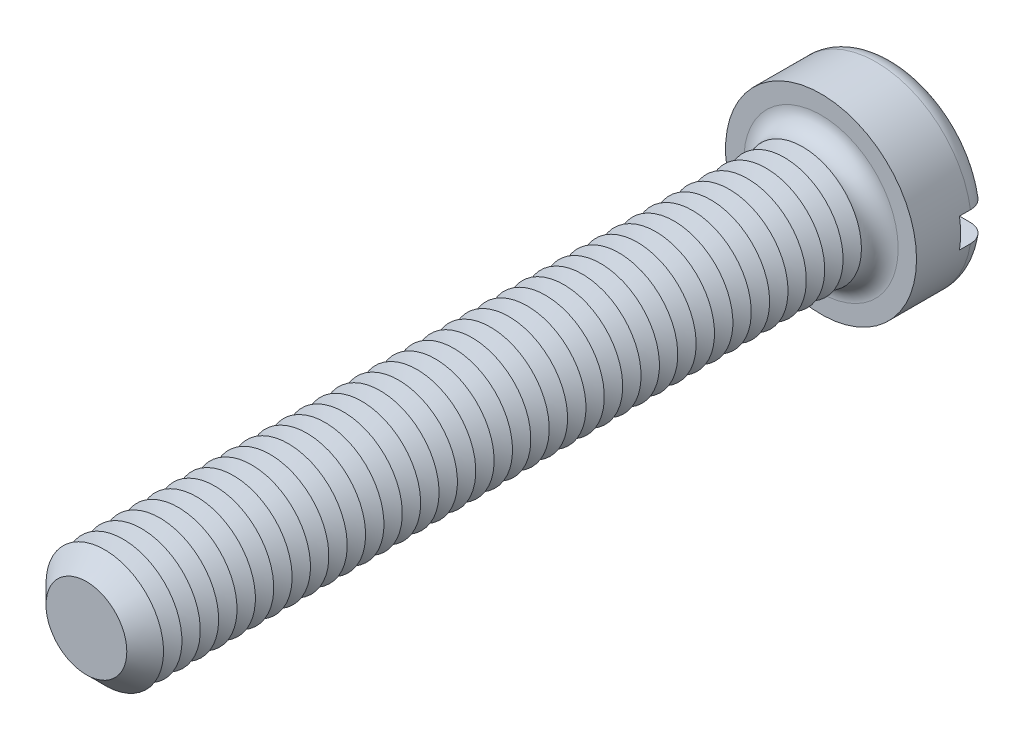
ISO-10303-21;
HEADER;
FILE_DESCRIPTION(('STEP AP214'),'2;1');
FILE_NAME('part.step','',(''),(''),'','','');
FILE_SCHEMA(('AUTOMOTIVE_DESIGN { 1 0 10303 214 1 1 1 1 }'));
ENDSEC;
DATA;
#1=APPLICATION_CONTEXT('core data for automotive mechanical design processes');
#2=APPLICATION_PROTOCOL_DEFINITION('international standard','automotive_design',2000,#1);
#3=PRODUCT_CONTEXT('',#1,'mechanical');
#4=PRODUCT('Part','Part','',(#3));
#5=PRODUCT_RELATED_PRODUCT_CATEGORY('part','',(#4));
#6=PRODUCT_DEFINITION_FORMATION('','',#4);
#7=PRODUCT_DEFINITION_CONTEXT('part definition',#1,'design');
#8=PRODUCT_DEFINITION('design','',#6,#7);
#9=PRODUCT_DEFINITION_SHAPE('','',#8);
#10=(LENGTH_UNIT() NAMED_UNIT(*) SI_UNIT(.MILLI.,.METRE.));
#11=(NAMED_UNIT(*) PLANE_ANGLE_UNIT() SI_UNIT($,.RADIAN.));
#12=(NAMED_UNIT(*) SI_UNIT($,.STERADIAN.) SOLID_ANGLE_UNIT());
#13=UNCERTAINTY_MEASURE_WITH_UNIT(LENGTH_MEASURE(1.E-05),#10,'distance_accuracy_value','');
#14=(GEOMETRIC_REPRESENTATION_CONTEXT(3) GLOBAL_UNCERTAINTY_ASSIGNED_CONTEXT((#13)) GLOBAL_UNIT_ASSIGNED_CONTEXT((#10,
#11,#12)) REPRESENTATION_CONTEXT('',''));
#15=CARTESIAN_POINT('',(0.,0.,0.));
#16=DIRECTION('',(0.,0.,1.));
#17=DIRECTION('',(1.,0.,0.));
#18=AXIS2_PLACEMENT_3D('',#15,#16,#17);
#19=CARTESIAN_POINT('',(0.,0.,-5.));
#20=DIRECTION('',(0.,0.,1.));
#21=DIRECTION('',(1.,0.,0.));
#22=AXIS2_PLACEMENT_3D('',#19,#20,#21);
#23=PLANE('',#22);
#24=CARTESIAN_POINT('',(0.,0.,-5.));
#25=DIRECTION('',(0.,0.,1.));
#26=DIRECTION('',(1.,0.,0.));
#27=AXIS2_PLACEMENT_3D('',#24,#25,#26);
#28=CIRCLE('',#27,5.25);
#29=CARTESIAN_POINT('',(-5.15388203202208,1.,-5.));
#30=VERTEX_POINT('',#29);
#31=CARTESIAN_POINT('',(5.15388203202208,1.,-5.));
#32=VERTEX_POINT('',#31);
#33=EDGE_CURVE('E116',#30,#32,#28,.F.);
#34=ORIENTED_EDGE('',*,*,#33,.T.);
#35=DIRECTION('',(1.,0.,0.));
#36=VECTOR('',#35,1.);
#37=CARTESIAN_POINT('',(-6.5,1.,-5.));
#38=LINE('',#37,#36);
#39=EDGE_CURVE('E111',#30,#32,#38,.T.);
#40=ORIENTED_EDGE('',*,*,#39,.F.);
#41=EDGE_LOOP('',(#34,#40));
#42=FACE_BOUND('',#41,.T.);
#43=ADVANCED_FACE('F39',(#42),#23,.F.);
#44=CARTESIAN_POINT('',(0.,0.,-3.75));
#45=DIRECTION('',(0.,0.,1.));
#46=DIRECTION('',(1.,0.,0.));
#47=AXIS2_PLACEMENT_3D('',#44,#45,#46);
#48=TOROIDAL_SURFACE('',#47,5.25,1.25);
#49=CARTESIAN_POINT('',(-6.04655789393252,1.,-4.63904490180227));
#50=CARTESIAN_POINT('',(-5.99546860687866,1.,-4.68885774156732));
#51=CARTESIAN_POINT('',(-5.94008472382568,1.,-4.73434760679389));
#52=CARTESIAN_POINT('',(-5.8223927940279,1.,-4.81538052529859));
#53=CARTESIAN_POINT('',(-5.7600753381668,1.,-4.85090982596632));
#54=CARTESIAN_POINT('',(-5.63044351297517,1.,-4.91100606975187));
#55=CARTESIAN_POINT('',(-5.56313479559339,1.,-4.93558519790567));
#56=CARTESIAN_POINT('',(-5.42539577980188,1.,-4.97322457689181));
#57=CARTESIAN_POINT('',(-5.35496625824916,1.,-4.98628767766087));
#58=CARTESIAN_POINT('',(-5.21212635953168,1.,-5.00070478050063));
#59=CARTESIAN_POINT('',(-5.13970265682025,1.,-5.00192674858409));
#60=CARTESIAN_POINT('',(-4.99565121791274,1.,-4.99234085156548));
#61=CARTESIAN_POINT('',(-4.92402357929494,1.,-4.98153152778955));
#62=CARTESIAN_POINT('',(-4.78274786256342,1.,-4.94801424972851));
#63=CARTESIAN_POINT('',(-4.71313137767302,1.,-4.92517296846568));
#64=CARTESIAN_POINT('',(-4.57871041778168,1.,-4.86813760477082));
#65=CARTESIAN_POINT('',(-4.51390612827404,1.,-4.83394308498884));
#66=CARTESIAN_POINT('',(-4.39095493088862,1.,-4.75508341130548));
#67=CARTESIAN_POINT('',(-4.33281197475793,1.,-4.7104120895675));
#68=CARTESIAN_POINT('',(-4.22499800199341,1.,-4.61179869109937));
#69=CARTESIAN_POINT('',(-4.17532640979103,1.,-4.55785724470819));
#70=CARTESIAN_POINT('',(-4.08677450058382,1.,-4.4431082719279));
#71=CARTESIAN_POINT('',(-4.0477350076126,1.,-4.38242369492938));
#72=CARTESIAN_POINT('',(-3.98074296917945,1.,-4.25521412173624));
#73=CARTESIAN_POINT('',(-3.95278836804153,1.,-4.18869021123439));
#74=CARTESIAN_POINT('',(-3.90959497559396,1.,-4.0537026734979));
#75=CARTESIAN_POINT('',(-3.89401985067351,1.,-3.98534663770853));
#76=CARTESIAN_POINT('',(-3.8748586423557,1.,-3.84697740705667));
#77=CARTESIAN_POINT('',(-3.87127067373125,1.,-3.7769644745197));
#78=CARTESIAN_POINT('',(-3.8761573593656,1.,-3.63892215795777));
#79=CARTESIAN_POINT('',(-3.88436651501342,1.,-3.57088319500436));
#80=CARTESIAN_POINT('',(-3.91207743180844,1.,-3.43714958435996));
#81=CARTESIAN_POINT('',(-3.93157911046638,1.,-3.37145491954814));
#82=CARTESIAN_POINT('',(-3.98125045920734,1.,-3.24411474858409));
#83=CARTESIAN_POINT('',(-4.01143761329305,1.,-3.18247607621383));
#84=CARTESIAN_POINT('',(-4.08150210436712,1.,-3.064981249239));
#85=CARTESIAN_POINT('',(-4.12138048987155,1.,-3.0091257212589));
#86=CARTESIAN_POINT('',(-4.2106718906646,1.,-2.90336353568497));
#87=CARTESIAN_POINT('',(-4.26028693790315,1.,-2.85362751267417));
#88=CARTESIAN_POINT('',(-4.36696587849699,1.,-2.76291710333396));
#89=CARTESIAN_POINT('',(-4.42403082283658,1.,-2.72194395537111));
#90=CARTESIAN_POINT('',(-4.54567957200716,1.,-2.64877280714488));
#91=CARTESIAN_POINT('',(-4.61042643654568,1.,-2.61684571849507));
#92=CARTESIAN_POINT('',(-4.74430563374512,1.,-2.56412359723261));
#93=CARTESIAN_POINT('',(-4.81343838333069,1.,-2.54332962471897));
#94=CARTESIAN_POINT('',(-4.95527237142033,1.,-2.51320471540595));
#95=CARTESIAN_POINT('',(-5.0280120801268,1.,-2.50405449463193));
#96=CARTESIAN_POINT('',(-5.17399775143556,1.,-2.49810126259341));
#97=CARTESIAN_POINT('',(-5.24724372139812,1.,-2.50129843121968));
#98=CARTESIAN_POINT('',(-5.3921014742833,1.,-2.52000776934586));
#99=CARTESIAN_POINT('',(-5.4637142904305,1.,-2.53551191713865));
#100=CARTESIAN_POINT('',(-5.60326680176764,1.,-2.57846304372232));
#101=CARTESIAN_POINT('',(-5.67120668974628,1.,-2.60590939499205));
#102=CARTESIAN_POINT('',(-5.80064060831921,1.,-2.67164926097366));
#103=CARTESIAN_POINT('',(-5.862199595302,1.,-2.7098148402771));
#104=CARTESIAN_POINT('',(-5.9779079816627,1.,-2.79608690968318));
#105=CARTESIAN_POINT('',(-6.03205795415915,1.,-2.84419263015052));
#106=CARTESIAN_POINT('',(-6.13055119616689,1.,-2.94820522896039));
#107=CARTESIAN_POINT('',(-6.17502887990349,1.,-3.00398483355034));
#108=CARTESIAN_POINT('',(-6.25384180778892,1.,-3.12230113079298));
#109=CARTESIAN_POINT('',(-6.28817779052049,1.,-3.18483733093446));
#110=CARTESIAN_POINT('',(-6.34527986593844,1.,-3.31401726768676));
#111=CARTESIAN_POINT('',(-6.36818984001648,1.,-3.38059742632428));
#112=CARTESIAN_POINT('',(-6.40240470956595,1.,-3.5166725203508));
#113=CARTESIAN_POINT('',(-6.41371067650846,1.,-3.58616718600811));
#114=CARTESIAN_POINT('',(-6.42433240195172,1.,-3.72550026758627));
#115=CARTESIAN_POINT('',(-6.4237441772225,1.,-3.79533138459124));
#116=CARTESIAN_POINT('',(-6.41082814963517,1.,-3.93391789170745));
#117=CARTESIAN_POINT('',(-6.39849757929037,1.,-4.00267302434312));
#118=CARTESIAN_POINT('',(-6.36249191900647,1.,-4.13704597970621));
#119=CARTESIAN_POINT('',(-6.33883072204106,1.,-4.20266753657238));
#120=CARTESIAN_POINT('',(-6.28088769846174,1.,-4.32897165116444));
#121=CARTESIAN_POINT('',(-6.24661890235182,1.,-4.38966015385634));
#122=CARTESIAN_POINT('',(-6.18404039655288,1.,-4.48163773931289));
#123=CARTESIAN_POINT('',(-6.15876600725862,1.,-4.51503333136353));
#124=CARTESIAN_POINT('',(-6.10500607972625,1.,-4.5791298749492));
#125=CARTESIAN_POINT('',(-6.07652056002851,1.,-4.60983084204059));
#126=CARTESIAN_POINT('',(-6.04655789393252,1.,-4.63904490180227));
#127=B_SPLINE_CURVE_WITH_KNOTS('',3,(#49,#50,#51,#52,#53,#54,#55,#56,#57,#58,#59,#60,#61,#62,
#63,#64,#65,#66,#67,#68,#69,#70,#71,#72,#73,#74,#75,#76,#77,#78,#79,#80,#81,#82,#83,#84,#85,#86,
#87,#88,#89,#90,#91,#92,#93,#94,#95,#96,#97,#98,#99,#100,#101,#102,#103,#104,#105,#106,#107,
#108,#109,#110,#111,#112,#113,#114,#115,#116,#117,#118,#119,#120,#121,#122,#123,#124,#125,#126),
.UNSPECIFIED.,.T.,.F.,(4,2,2,2,2,2,2,2,2,2,2,2,2,2,2,2,2,2,2,2,2,2,2,2,2,2,2,2,2,2,2,2,2,2,2,2,
2,2,4),(0.,0.213907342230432,0.428108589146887,0.642070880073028,0.855980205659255,
1.07227200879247,1.28859003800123,1.50735715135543,1.72613269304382,1.94503735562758,
2.16392713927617,2.37933295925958,2.59469881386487,2.80399176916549,3.01325180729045,
3.2178754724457,3.42249764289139,3.62745618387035,3.83243690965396,4.04223444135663,
4.25206160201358,4.46763253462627,4.68322399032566,4.90212226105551,5.12102372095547,
5.33978261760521,5.55853002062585,5.77477015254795,5.99099354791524,6.20398686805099,
6.41696467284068,6.62718821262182,6.83739233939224,7.0459002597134,7.25445733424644,
7.46275934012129,7.67080647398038,7.79625882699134,7.92171045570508),.UNSPECIFIED.);
#128=CARTESIAN_POINT('',(-6.42261628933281,1.,-3.74999999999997));
#129=VERTEX_POINT('',#128);
#130=EDGE_CURVE('E482',#129,#30,#127,.T.);
#131=ORIENTED_EDGE('',*,*,#130,.F.);
#132=CARTESIAN_POINT('',(0.,0.,-3.75));
#133=DIRECTION('',(0.,0.,1.));
#134=DIRECTION('',(1.,0.,0.));
#135=AXIS2_PLACEMENT_3D('',#132,#133,#134);
#136=CIRCLE('',#135,6.5);
#137=CARTESIAN_POINT('',(6.42261628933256,1.,-3.75));
#138=VERTEX_POINT('',#137);
#139=EDGE_CURVE('E124',#138,#129,#136,.T.);
#140=ORIENTED_EDGE('',*,*,#139,.F.);
#141=CARTESIAN_POINT('',(4.06944999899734,1.,-4.4133199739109));
#142=CARTESIAN_POINT('',(4.10828271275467,1.,-4.47354709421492));
#143=CARTESIAN_POINT('',(4.15233880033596,1.,-4.53047894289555));
#144=CARTESIAN_POINT('',(4.24946916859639,1.,-4.63614530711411));
#145=CARTESIAN_POINT('',(4.3025574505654,1.,-4.68486685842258));
#146=CARTESIAN_POINT('',(4.41603250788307,1.,-4.77271114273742));
#147=CARTESIAN_POINT('',(4.47640839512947,1.,-4.8118479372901));
#148=CARTESIAN_POINT('',(4.60277035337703,1.,-4.87959878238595));
#149=CARTESIAN_POINT('',(4.66875480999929,1.,-4.90821584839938));
#150=CARTESIAN_POINT('',(4.80558589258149,1.,-4.95456537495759));
#151=CARTESIAN_POINT('',(4.87649196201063,1.,-4.97212253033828));
#152=CARTESIAN_POINT('',(5.02024710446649,1.,-4.99514979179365));
#153=CARTESIAN_POINT('',(5.09309636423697,1.,-5.00061873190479));
#154=CARTESIAN_POINT('',(5.23902872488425,1.,-4.99926689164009));
#155=CARTESIAN_POINT('',(5.31211131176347,1.,-4.99238812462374));
#156=CARTESIAN_POINT('',(5.45605806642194,1.,-4.96635140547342));
#157=CARTESIAN_POINT('',(5.52692231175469,1.,-4.94719388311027));
#158=CARTESIAN_POINT('',(5.66376170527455,1.,-4.89728421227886));
#159=CARTESIAN_POINT('',(5.72977335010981,1.,-4.86663219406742));
#160=CARTESIAN_POINT('',(5.85560715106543,1.,-4.79452334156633));
#161=CARTESIAN_POINT('',(5.91542977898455,1.,-4.7530673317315));
#162=CARTESIAN_POINT('',(6.02626022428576,1.,-4.66116821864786));
#163=CARTESIAN_POINT('',(6.07738307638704,1.,-4.6108638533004));
#164=CARTESIAN_POINT('',(6.17030947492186,1.,-4.50227823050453));
#165=CARTESIAN_POINT('',(6.2121137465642,1.,-4.44399759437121));
#166=CARTESIAN_POINT('',(6.28460268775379,1.,-4.32200305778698));
#167=CARTESIAN_POINT('',(6.31543589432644,1.,-4.2583773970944));
#168=CARTESIAN_POINT('',(6.36586009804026,1.,-4.12681721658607));
#169=CARTESIAN_POINT('',(6.38545178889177,1.,-4.0588829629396));
#170=CARTESIAN_POINT('',(6.41265760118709,1.,-3.92136007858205));
#171=CARTESIAN_POINT('',(6.42038873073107,1.,-3.85179457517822));
#172=CARTESIAN_POINT('',(6.42401070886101,1.,-3.7123569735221));
#173=CARTESIAN_POINT('',(6.41990193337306,1.,-3.64248488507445));
#174=CARTESIAN_POINT('',(6.40000894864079,1.,-3.50470871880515));
#175=CARTESIAN_POINT('',(6.38427119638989,1.,-3.43679792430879));
#176=CARTESIAN_POINT('',(6.34164491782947,1.,-3.30457296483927));
#177=CARTESIAN_POINT('',(6.31475638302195,1.,-3.24025880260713));
#178=CARTESIAN_POINT('',(6.2505455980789,1.,-3.11686791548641));
#179=CARTESIAN_POINT('',(6.21319759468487,1.,-3.05780459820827));
#180=CARTESIAN_POINT('',(6.12919411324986,1.,-2.94671919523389));
#181=CARTESIAN_POINT('',(6.08253833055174,1.,-2.89469734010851));
#182=CARTESIAN_POINT('',(5.98083387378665,1.,-2.79868150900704));
#183=CARTESIAN_POINT('',(5.92571704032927,1.,-2.75475975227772));
#184=CARTESIAN_POINT('',(5.80897194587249,1.,-2.67665277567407));
#185=CARTESIAN_POINT('',(5.74734329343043,1.,-2.64246814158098));
#186=CARTESIAN_POINT('',(5.6184644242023,1.,-2.58431810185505));
#187=CARTESIAN_POINT('',(5.55115102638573,1.,-2.56049275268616));
#188=CARTESIAN_POINT('',(5.41351272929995,1.,-2.52429868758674));
#189=CARTESIAN_POINT('',(5.34318759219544,1.,-2.51193087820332));
#190=CARTESIAN_POINT('',(5.20041507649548,1.,-2.49882112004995));
#191=CARTESIAN_POINT('',(5.12795169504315,1.,-2.49825332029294));
#192=CARTESIAN_POINT('',(4.98393373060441,1.,-2.50914771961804));
#193=CARTESIAN_POINT('',(4.91237921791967,1.,-2.52061084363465));
#194=CARTESIAN_POINT('',(4.77137358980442,1.,-2.55542281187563));
#195=CARTESIAN_POINT('',(4.70195472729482,1.,-2.57890245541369));
#196=CARTESIAN_POINT('',(4.56803538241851,1.,-2.63717701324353));
#197=CARTESIAN_POINT('',(4.50353509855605,1.,-2.67197238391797));
#198=CARTESIAN_POINT('',(4.38131858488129,1.,-2.7519648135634));
#199=CARTESIAN_POINT('',(4.32360365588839,1.,-2.79716386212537));
#200=CARTESIAN_POINT('',(4.21673400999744,1.,-2.89675634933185));
#201=CARTESIAN_POINT('',(4.16757871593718,1.,-2.95114916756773));
#202=CARTESIAN_POINT('',(4.08014713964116,1.,-3.06667703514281));
#203=CARTESIAN_POINT('',(4.04170608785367,1.,-3.12768727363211));
#204=CARTESIAN_POINT('',(3.97596192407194,1.,-3.25543782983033));
#205=CARTESIAN_POINT('',(3.94865624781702,1.,-3.32217682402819));
#206=CARTESIAN_POINT('',(3.9067737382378,1.,-3.45745603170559));
#207=CARTESIAN_POINT('',(3.89185707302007,1.,-3.52589108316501));
#208=CARTESIAN_POINT('',(3.87400755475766,1.,-3.66432360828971));
#209=CARTESIAN_POINT('',(3.87107601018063,1.,-3.73432125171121));
#210=CARTESIAN_POINT('',(3.8772387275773,1.,-3.87228267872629));
#211=CARTESIAN_POINT('',(3.88607933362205,1.,-3.94025811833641));
#212=CARTESIAN_POINT('',(3.91502769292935,1.,-4.07370133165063));
#213=CARTESIAN_POINT('',(3.93512131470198,1.,-4.1391721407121));
#214=CARTESIAN_POINT('',(3.9752037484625,1.,-4.23926719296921));
#215=CARTESIAN_POINT('',(3.99171171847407,1.,-4.27532618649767));
#216=CARTESIAN_POINT('',(4.02809737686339,1.,-4.34569933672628));
#217=CARTESIAN_POINT('',(4.04797497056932,1.,-4.3800135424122));
#218=CARTESIAN_POINT('',(4.06944999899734,1.,-4.4133199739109));
#219=B_SPLINE_CURVE_WITH_KNOTS('',3,(#141,#142,#143,#144,#145,#146,#147,#148,#149,#150,#151,
#152,#153,#154,#155,#156,#157,#158,#159,#160,#161,#162,#163,#164,#165,#166,#167,#168,#169,#170,
#171,#172,#173,#174,#175,#176,#177,#178,#179,#180,#181,#182,#183,#184,#185,#186,#187,#188,#189,
#190,#191,#192,#193,#194,#195,#196,#197,#198,#199,#200,#201,#202,#203,#204,#205,#206,#207,#208,
#209,#210,#211,#212,#213,#214,#215,#216,#217,#218),.UNSPECIFIED.,.T.,.F.,(4,2,2,2,2,2,2,2,2,2,2,
2,2,2,2,2,2,2,2,2,2,2,2,2,2,2,2,2,2,2,2,2,2,2,2,2,2,2,4),(0.,0.214833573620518,
0.430003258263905,0.644855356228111,0.859645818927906,1.0777603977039,1.29589601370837,
1.51505870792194,1.73421373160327,1.95150241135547,2.16877451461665,2.38290237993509,
2.59701357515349,2.8081044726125,3.01918234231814,3.22816416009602,3.43713934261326,
3.64528416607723,3.85342914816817,4.06209119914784,4.27076008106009,4.48120788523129,
4.69166834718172,4.90489186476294,5.11813225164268,5.33451752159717,5.55091942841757,
5.76972860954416,5.98854661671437,6.20740650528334,6.42625163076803,6.64151774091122,
6.85673425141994,7.0658317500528,7.27495207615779,7.47963858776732,7.68406862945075,
7.80287790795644,7.92168384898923),.UNSPECIFIED.);
#220=EDGE_CURVE('E484',#32,#138,#219,.T.);
#221=ORIENTED_EDGE('',*,*,#220,.F.);
#222=ORIENTED_EDGE('',*,*,#33,.F.);
#223=EDGE_LOOP('',(#131,#140,#221,#222));
#224=FACE_BOUND('',#223,.T.);
#225=ADVANCED_FACE('F466',(#224),#48,.T.);
#226=CARTESIAN_POINT('',(0.,0.,-5.));
#227=DIRECTION('',(0.,0.,1.));
#228=DIRECTION('',(1.,0.,0.));
#229=AXIS2_PLACEMENT_3D('',#226,#227,#228);
#230=CYLINDRICAL_SURFACE('',#229,6.5);
#231=DIRECTION('',(0.,0.,1.));
#232=VECTOR('',#231,1.);
#233=CARTESIAN_POINT('',(6.42261628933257,1.,-5.));
#234=LINE('',#233,#232);
#235=CARTESIAN_POINT('',(6.42261628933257,1.,-3.));
#236=VERTEX_POINT('',#235);
#237=EDGE_CURVE('E500',#138,#236,#234,.T.);
#238=ORIENTED_EDGE('',*,*,#237,.F.);
#239=ORIENTED_EDGE('',*,*,#139,.T.);
#240=DIRECTION('',(0.,0.,1.));
#241=VECTOR('',#240,1.);
#242=CARTESIAN_POINT('',(-6.42261628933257,1.,-5.));
#243=LINE('',#242,#241);
#244=CARTESIAN_POINT('',(-6.42261628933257,1.,-3.));
#245=VERTEX_POINT('',#244);
#246=EDGE_CURVE('E63',#245,#129,#243,.F.);
#247=ORIENTED_EDGE('',*,*,#246,.F.);
#248=CARTESIAN_POINT('',(0.,0.,-3.));
#249=DIRECTION('',(0.,0.,-1.));
#250=DIRECTION('',(-1.,0.,0.));
#251=AXIS2_PLACEMENT_3D('',#248,#249,#250);
#252=CIRCLE('',#251,6.5);
#253=CARTESIAN_POINT('',(-6.42261628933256,-0.999999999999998,-3.));
#254=VERTEX_POINT('',#253);
#255=EDGE_CURVE('E43',#245,#254,#252,.F.);
#256=ORIENTED_EDGE('',*,*,#255,.T.);
#257=DIRECTION('',(0.,0.,1.));
#258=VECTOR('',#257,1.);
#259=CARTESIAN_POINT('',(-6.42261628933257,-0.999999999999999,-5.));
#260=LINE('',#259,#258);
#261=CARTESIAN_POINT('',(-6.42261628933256,-0.999999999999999,-3.75));
#262=VERTEX_POINT('',#261);
#263=EDGE_CURVE('E497',#262,#254,#260,.T.);
#264=ORIENTED_EDGE('',*,*,#263,.F.);
#265=CARTESIAN_POINT('',(6.42261628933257,-1.,-3.75));
#266=VERTEX_POINT('',#265);
#267=EDGE_CURVE('E126',#262,#266,#136,.T.);
#268=ORIENTED_EDGE('',*,*,#267,.T.);
#269=DIRECTION('',(0.,0.,1.));
#270=VECTOR('',#269,1.);
#271=CARTESIAN_POINT('',(6.42261628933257,-1.,-5.));
#272=LINE('',#271,#270);
#273=CARTESIAN_POINT('',(6.42261628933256,-1.,-3.));
#274=VERTEX_POINT('',#273);
#275=EDGE_CURVE('E55',#274,#266,#272,.F.);
#276=ORIENTED_EDGE('',*,*,#275,.F.);
#277=EDGE_CURVE('E11',#274,#236,#252,.F.);
#278=ORIENTED_EDGE('',*,*,#277,.T.);
#279=EDGE_LOOP('',(#238,#239,#247,#256,#264,#268,#276,#278));
#280=FACE_BOUND('',#279,.T.);
#281=CARTESIAN_POINT('',(0.,0.,0.));
#282=DIRECTION('',(0.,0.,1.));
#283=DIRECTION('',(1.,0.,0.));
#284=AXIS2_PLACEMENT_3D('',#281,#282,#283);
#285=CIRCLE('',#284,6.5);
#286=CARTESIAN_POINT('',(6.5,0.,0.));
#287=VERTEX_POINT('',#286);
#288=EDGE_CURVE('E503',#287,#287,#285,.T.);
#289=ORIENTED_EDGE('',*,*,#288,.F.);
#290=EDGE_LOOP('',(#289));
#291=FACE_BOUND('',#290,.T.);
#292=ADVANCED_FACE('F462',(#280,#291),#230,.T.);
#293=CARTESIAN_POINT('',(5.15388203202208,-1.,-5.));
#294=VERTEX_POINT('',#293);
#295=CARTESIAN_POINT('',(-5.15388203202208,-0.999999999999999,-5.));
#296=VERTEX_POINT('',#295);
#297=EDGE_CURVE('E109',#294,#296,#28,.F.);
#298=ORIENTED_EDGE('',*,*,#297,.T.);
#299=DIRECTION('',(-1.,0.,0.));
#300=VECTOR('',#299,1.);
#301=CARTESIAN_POINT('',(-6.5,-0.999999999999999,-5.));
#302=LINE('',#301,#300);
#303=EDGE_CURVE('E96',#294,#296,#302,.T.);
#304=ORIENTED_EDGE('',*,*,#303,.F.);
#305=EDGE_LOOP('',(#298,#304));
#306=FACE_BOUND('',#305,.T.);
#307=ADVANCED_FACE('F108',(#306),#23,.F.);
#308=CARTESIAN_POINT('',(0.,0.,0.));
#309=DIRECTION('',(0.,0.,1.));
#310=DIRECTION('',(1.,0.,0.));
#311=AXIS2_PLACEMENT_3D('',#308,#309,#310);
#312=PLANE('',#311);
#313=CARTESIAN_POINT('',(0.,0.,0.));
#314=DIRECTION('',(0.,0.,1.));
#315=DIRECTION('',(1.,0.,0.));
#316=AXIS2_PLACEMENT_3D('',#313,#314,#315);
#317=CIRCLE('',#316,5.25);
#318=CARTESIAN_POINT('',(5.25,0.,0.));
#319=VERTEX_POINT('',#318);
#320=EDGE_CURVE('E115',#319,#319,#317,.F.);
#321=ORIENTED_EDGE('',*,*,#320,.T.);
#322=EDGE_LOOP('',(#321));
#323=FACE_BOUND('',#322,.T.);
#324=ORIENTED_EDGE('',*,*,#288,.T.);
#325=EDGE_LOOP('',(#324));
#326=FACE_BOUND('',#325,.T.);
#327=ADVANCED_FACE('F461',(#323,#326),#312,.T.);
#328=CARTESIAN_POINT('',(-6.04655789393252,-0.999999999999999,-4.63904490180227));
#329=CARTESIAN_POINT('',(-6.0966604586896,-0.999999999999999,-4.59018532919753));
#330=CARTESIAN_POINT('',(-6.14270501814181,-0.999999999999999,-4.53709744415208));
#331=CARTESIAN_POINT('',(-6.22528519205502,-0.999999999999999,-4.42391631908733));
#332=CARTESIAN_POINT('',(-6.26181074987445,-0.999999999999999,-4.36381576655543));
#333=CARTESIAN_POINT('',(-6.32422109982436,-0.999999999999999,-4.23831836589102));
#334=CARTESIAN_POINT('',(-6.35010658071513,-0.999999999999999,-4.17292186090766));
#335=CARTESIAN_POINT('',(-6.39044668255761,-0.999999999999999,-4.03870925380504));
#336=CARTESIAN_POINT('',(-6.40490396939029,-0.999999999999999,-3.96989395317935));
#337=CARTESIAN_POINT('',(-6.42190814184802,-0.999999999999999,-3.83122595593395));
#338=CARTESIAN_POINT('',(-6.4245257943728,-0.999999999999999,-3.76138193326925));
#339=CARTESIAN_POINT('',(-6.41796432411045,-0.999999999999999,-3.62224935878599));
#340=CARTESIAN_POINT('',(-6.40878509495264,-0.999999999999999,-3.55296081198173));
#341=CARTESIAN_POINT('',(-6.37894560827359,-0.999999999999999,-3.41709241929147));
#342=CARTESIAN_POINT('',(-6.35831520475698,-0.999999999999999,-3.35050601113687));
#343=CARTESIAN_POINT('',(-6.30620980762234,-0.999999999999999,-3.22172312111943));
#344=CARTESIAN_POINT('',(-6.2747347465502,-0.999999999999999,-3.15952666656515));
#345=CARTESIAN_POINT('',(-6.20172710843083,-0.999999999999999,-3.04101762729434));
#346=CARTESIAN_POINT('',(-6.16015622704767,-0.999999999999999,-2.98472864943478));
#347=CARTESIAN_POINT('',(-6.06823774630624,-0.999999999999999,-2.87984578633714));
#348=CARTESIAN_POINT('',(-6.01788981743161,-0.999999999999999,-2.83125219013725));
#349=CARTESIAN_POINT('',(-5.90933830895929,-0.999999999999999,-2.74262118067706));
#350=CARTESIAN_POINT('',(-5.85106338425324,-0.999999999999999,-2.70267117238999));
#351=CARTESIAN_POINT('',(-5.72870702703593,-0.999999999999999,-2.63296796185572));
#352=CARTESIAN_POINT('',(-5.66462521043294,-0.999999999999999,-2.6032154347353));
#353=CARTESIAN_POINT('',(-5.53153273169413,-0.999999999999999,-2.55430842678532));
#354=CARTESIAN_POINT('',(-5.46246626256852,-0.999999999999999,-2.53530583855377));
#355=CARTESIAN_POINT('',(-5.32214267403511,-0.999999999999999,-2.5089831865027));
#356=CARTESIAN_POINT('',(-5.25088537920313,-0.999999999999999,-2.50166406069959));
#357=CARTESIAN_POINT('',(-5.10710123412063,-0.999999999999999,-2.49882202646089));
#358=CARTESIAN_POINT('',(-5.03457095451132,-0.999999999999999,-2.50347166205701));
#359=CARTESIAN_POINT('',(-4.8912897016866,-0.999999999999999,-2.52476029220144));
#360=CARTESIAN_POINT('',(-4.82053886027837,-0.999999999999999,-2.54140017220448));
#361=CARTESIAN_POINT('',(-4.68213257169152,-0.999999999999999,-2.58641614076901));
#362=CARTESIAN_POINT('',(-4.61451256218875,-0.999999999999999,-2.61490131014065));
#363=CARTESIAN_POINT('',(-4.48502801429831,-0.999999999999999,-2.68285095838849));
#364=CARTESIAN_POINT('',(-4.42316359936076,-0.999999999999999,-2.72231567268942));
#365=CARTESIAN_POINT('',(-4.30720694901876,-0.999999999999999,-2.81103994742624));
#366=CARTESIAN_POINT('',(-4.25309118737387,-0.999999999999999,-2.86026872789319));
#367=CARTESIAN_POINT('',(-4.15409408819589,-0.999999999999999,-2.9672764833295));
#368=CARTESIAN_POINT('',(-4.10921182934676,-0.999999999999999,-3.02505460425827));
#369=CARTESIAN_POINT('',(-4.03096584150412,-0.999999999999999,-3.14632492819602));
#370=CARTESIAN_POINT('',(-3.99739097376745,-0.999999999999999,-3.2096807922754));
#371=CARTESIAN_POINT('',(-3.94171839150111,-0.999999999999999,-3.34124912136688));
#372=CARTESIAN_POINT('',(-3.91961840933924,-0.999999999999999,-3.40946062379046));
#373=CARTESIAN_POINT('',(-3.88816636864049,-0.999999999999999,-3.54669256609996));
#374=CARTESIAN_POINT('',(-3.87846562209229,-0.999999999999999,-3.61563318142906));
#375=CARTESIAN_POINT('',(-3.87100568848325,-0.999999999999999,-3.75415397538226));
#376=CARTESIAN_POINT('',(-3.87324501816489,-0.999999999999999,-3.82373407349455));
#377=CARTESIAN_POINT('',(-3.88943589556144,-0.999999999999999,-3.96027701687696));
#378=CARTESIAN_POINT('',(-3.90318225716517,-0.999999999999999,-4.0272643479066));
#379=CARTESIAN_POINT('',(-3.94163954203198,-0.999999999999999,-4.1580093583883));
#380=CARTESIAN_POINT('',(-3.96635075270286,-0.999999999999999,-4.22176695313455));
#381=CARTESIAN_POINT('',(-4.026160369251,-0.999999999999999,-4.34483320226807));
#382=CARTESIAN_POINT('',(-4.06134035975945,-0.999999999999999,-4.40410214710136));
#383=CARTESIAN_POINT('',(-4.14090865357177,-0.999999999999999,-4.51609417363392));
#384=CARTESIAN_POINT('',(-4.18529811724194,-0.999999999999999,-4.56881642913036));
#385=CARTESIAN_POINT('',(-4.2832649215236,-0.999999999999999,-4.66770177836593));
#386=CARTESIAN_POINT('',(-4.33705327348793,-0.999999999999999,-4.71365579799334));
#387=CARTESIAN_POINT('',(-4.45141776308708,-0.999999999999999,-4.79615385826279));
#388=CARTESIAN_POINT('',(-4.51199483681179,-0.999999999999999,-4.83269659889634));
#389=CARTESIAN_POINT('',(-4.63989216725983,-0.999999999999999,-4.89626962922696));
#390=CARTESIAN_POINT('',(-4.70734508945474,-0.999999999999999,-4.92303326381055));
#391=CARTESIAN_POINT('',(-4.84575497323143,-0.999999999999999,-4.96500199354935));
#392=CARTESIAN_POINT('',(-4.91671207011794,-0.999999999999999,-4.98020664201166));
#393=CARTESIAN_POINT('',(-5.06097761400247,-0.999999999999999,-4.9987306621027));
#394=CARTESIAN_POINT('',(-5.13430353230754,-0.999999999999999,-5.00191441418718));
#395=CARTESIAN_POINT('',(-5.28046546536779,-0.999999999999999,-4.99587686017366));
#396=CARTESIAN_POINT('',(-5.35330135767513,-0.999999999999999,-4.98665256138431));
#397=CARTESIAN_POINT('',(-5.49610354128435,-0.999999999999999,-4.95604184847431));
#398=CARTESIAN_POINT('',(-5.56607890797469,-0.999999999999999,-4.93469772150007));
#399=CARTESIAN_POINT('',(-5.70131538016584,-0.999999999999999,-4.88041956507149));
#400=CARTESIAN_POINT('',(-5.76658233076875,-0.999999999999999,-4.84750021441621));
#401=CARTESIAN_POINT('',(-5.86782577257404,-0.999999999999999,-4.78498748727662));
#402=CARTESIAN_POINT('',(-5.90579749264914,-0.999999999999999,-4.75856648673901));
#403=CARTESIAN_POINT('',(-5.97862186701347,-0.999999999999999,-4.70172646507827));
#404=CARTESIAN_POINT('',(-6.0134745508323,-0.999999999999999,-4.6713074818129));
#405=CARTESIAN_POINT('',(-6.04655789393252,-0.999999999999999,-4.63904490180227));
#406=B_SPLINE_CURVE_WITH_KNOTS('',3,(#328,#329,#330,#331,#332,#333,#334,#335,#336,#337,#338,
#339,#340,#341,#342,#343,#344,#345,#346,#347,#348,#349,#350,#351,#352,#353,#354,#355,#356,#357,
#358,#359,#360,#361,#362,#363,#364,#365,#366,#367,#368,#369,#370,#371,#372,#373,#374,#375,#376,
#377,#378,#379,#380,#381,#382,#383,#384,#385,#386,#387,#388,#389,#390,#391,#392,#393,#394,#395,
#396,#397,#398,#399,#400,#401,#402,#403,#404,#405),.UNSPECIFIED.,.T.,.F.,(4,2,2,2,2,2,2,2,2,2,2,
2,2,2,2,2,2,2,2,2,2,2,2,2,2,2,2,2,2,2,2,2,2,2,2,2,2,2,4),(0.,0.209780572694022,
0.419781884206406,0.629769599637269,0.839708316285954,1.04839053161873,1.2570746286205,
1.46521720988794,1.67336108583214,1.88230736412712,2.09126148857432,2.30223890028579,
2.51323027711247,2.72713284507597,2.94105258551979,3.15807345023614,3.37511034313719,
3.59419176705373,3.81327788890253,4.03168404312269,4.25006839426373,4.46411376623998,
4.67811682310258,4.88595885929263,5.09377507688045,5.29796268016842,5.50215563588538,
5.70798353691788,5.91383738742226,6.12510741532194,6.33640661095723,6.55309998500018,
6.76980173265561,6.98894112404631,7.20813337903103,7.42656551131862,7.64472163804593,
7.78324365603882,7.92176436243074),.UNSPECIFIED.);
#407=EDGE_CURVE('E103',#296,#262,#406,.T.);
#408=ORIENTED_EDGE('',*,*,#407,.F.);
#409=ORIENTED_EDGE('',*,*,#297,.F.);
#410=CARTESIAN_POINT('',(4.06944999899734,-1.,-4.4133199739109));
#411=CARTESIAN_POINT('',(4.03213207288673,-1.,-4.3554312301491));
#412=CARTESIAN_POINT('',(3.9995849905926,-1.,-4.29441722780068));
#413=CARTESIAN_POINT('',(3.94511822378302,-1.,-4.16776604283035));
#414=CARTESIAN_POINT('',(3.92320762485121,-1.,-4.10212496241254));
#415=CARTESIAN_POINT('',(3.89078811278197,-1.,-3.96804412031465));
#416=CARTESIAN_POINT('',(3.88028409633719,-1.,-3.89960316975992));
#417=CARTESIAN_POINT('',(3.87107895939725,-1.,-3.76194650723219));
#418=CARTESIAN_POINT('',(3.87237511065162,-1.,-3.69273097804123));
#419=CARTESIAN_POINT('',(3.88662927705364,-1.,-3.55634460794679));
#420=CARTESIAN_POINT('',(3.89944923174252,-1.,-3.48915926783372));
#421=CARTESIAN_POINT('',(3.93611188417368,-1.,-3.35786953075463));
#422=CARTESIAN_POINT('',(3.95995518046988,-1.,-3.29376530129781));
#423=CARTESIAN_POINT('',(4.0180748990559,-1.,-3.16993562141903));
#424=CARTESIAN_POINT('',(4.05242297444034,-1.,-3.11024385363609));
#425=CARTESIAN_POINT('',(4.13041121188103,-1.,-2.9972793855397));
#426=CARTESIAN_POINT('',(4.17405248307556,-1.,-2.94400745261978));
#427=CARTESIAN_POINT('',(4.27058636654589,-1.,-2.8439150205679));
#428=CARTESIAN_POINT('',(4.32368948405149,-1.,-2.79729757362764));
#429=CARTESIAN_POINT('',(4.43679856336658,-1.,-2.71336600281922));
#430=CARTESIAN_POINT('',(4.49680546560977,-1.,-2.67605314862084));
#431=CARTESIAN_POINT('',(4.62370121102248,-1.,-2.61081752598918));
#432=CARTESIAN_POINT('',(4.69072799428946,-1.,-2.58316284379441));
#433=CARTESIAN_POINT('',(4.82843981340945,-1.,-2.5393441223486));
#434=CARTESIAN_POINT('',(4.899125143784,-1.,-2.52318100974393));
#435=CARTESIAN_POINT('',(5.04306377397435,-1.,-2.50267755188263));
#436=CARTESIAN_POINT('',(5.11633773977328,-1.,-2.49848181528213));
#437=CARTESIAN_POINT('',(5.26254809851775,-1.,-2.50249357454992));
#438=CARTESIAN_POINT('',(5.33548449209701,-1.,-2.51070104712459));
#439=CARTESIAN_POINT('',(5.4786703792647,-1.,-2.53930888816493));
#440=CARTESIAN_POINT('',(5.54892819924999,-1.,-2.5596675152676));
#441=CARTESIAN_POINT('',(5.68495799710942,-1.,-2.61204238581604));
#442=CARTESIAN_POINT('',(5.75073024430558,-1.,-2.64405792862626));
#443=CARTESIAN_POINT('',(5.8750178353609,-1.,-2.7184150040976));
#444=CARTESIAN_POINT('',(5.93361487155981,-1.,-2.76061995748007));
#445=CARTESIAN_POINT('',(6.04275377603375,-1.,-2.85440601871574));
#446=CARTESIAN_POINT('',(6.09329629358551,-1.,-2.90598637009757));
#447=CARTESIAN_POINT('',(6.18409572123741,-1.,-3.01622977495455));
#448=CARTESIAN_POINT('',(6.2244945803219,-1.,-3.07477592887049));
#449=CARTESIAN_POINT('',(6.29474798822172,-1.,-3.19788594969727));
#450=CARTESIAN_POINT('',(6.3246032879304,-1.,-3.26244938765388));
#451=CARTESIAN_POINT('',(6.37256001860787,-1.,-3.39491634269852));
#452=CARTESIAN_POINT('',(6.39079949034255,-1.,-3.46276990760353));
#453=CARTESIAN_POINT('',(6.41554133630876,-1.,-3.60058363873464));
#454=CARTESIAN_POINT('',(6.42204424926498,-1.,-3.67054370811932));
#455=CARTESIAN_POINT('',(6.42311237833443,-1.,-3.81007982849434));
#456=CARTESIAN_POINT('',(6.41775799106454,-1.,-3.879655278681));
#457=CARTESIAN_POINT('',(6.39543799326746,-1.,-4.01691664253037));
#458=CARTESIAN_POINT('',(6.3784725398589,-1.,-4.08460258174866));
#459=CARTESIAN_POINT('',(6.33344768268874,-1.,-4.21614537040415));
#460=CARTESIAN_POINT('',(6.30539273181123,-1.,-4.28000374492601));
#461=CARTESIAN_POINT('',(6.23902076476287,-1.,-4.40214140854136));
#462=CARTESIAN_POINT('',(6.20070356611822,-1.,-4.46042059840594));
#463=CARTESIAN_POINT('',(6.11467174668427,-1.,-4.5701315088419));
#464=CARTESIAN_POINT('',(6.06690270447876,-1.,-4.62152053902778));
#465=CARTESIAN_POINT('',(5.96350111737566,-1.,-4.715657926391));
#466=CARTESIAN_POINT('',(5.90786817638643,-1.,-4.75840584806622));
#467=CARTESIAN_POINT('',(5.78965380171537,-1.,-4.8345781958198));
#468=CARTESIAN_POINT('',(5.72700078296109,-1.,-4.86789149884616));
#469=CARTESIAN_POINT('',(5.59704977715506,-1.,-4.92369754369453));
#470=CARTESIAN_POINT('',(5.52975144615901,-1.,-4.94618948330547));
#471=CARTESIAN_POINT('',(5.39137621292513,-1.,-4.98006173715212));
#472=CARTESIAN_POINT('',(5.32025859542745,-1.,-4.99127571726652));
#473=CARTESIAN_POINT('',(5.17715081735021,-1.,-5.00177798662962));
#474=CARTESIAN_POINT('',(5.10516061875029,-1.,-5.00106575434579));
#475=CARTESIAN_POINT('',(4.96131924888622,-1.,-4.98769775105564));
#476=CARTESIAN_POINT('',(4.88948297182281,-1.,-4.97488146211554));
#477=CARTESIAN_POINT('',(4.74893184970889,-1.,-4.93744335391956));
#478=CARTESIAN_POINT('',(4.68021795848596,-1.,-4.91281795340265));
#479=CARTESIAN_POINT('',(4.54744428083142,-1.,-4.8522329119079));
#480=CARTESIAN_POINT('',(4.48341761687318,-1.,-4.81620070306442));
#481=CARTESIAN_POINT('',(4.36244497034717,-1.,-4.73383277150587));
#482=CARTESIAN_POINT('',(4.30549069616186,-1.,-4.68750929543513));
#483=CARTESIAN_POINT('',(4.21823158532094,-1.,-4.60311228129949));
#484=CARTESIAN_POINT('',(4.18544074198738,-1.,-4.56757118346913));
#485=CARTESIAN_POINT('',(4.12413461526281,-1.,-4.49297229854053));
#486=CARTESIAN_POINT('',(4.09561926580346,-1.,-4.45391456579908));
#487=CARTESIAN_POINT('',(4.06944999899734,-1.,-4.4133199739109));
#488=B_SPLINE_CURVE_WITH_KNOTS('',3,(#410,#411,#412,#413,#414,#415,#416,#417,#418,#419,#420,
#421,#422,#423,#424,#425,#426,#427,#428,#429,#430,#431,#432,#433,#434,#435,#436,#437,#438,#439,
#440,#441,#442,#443,#444,#445,#446,#447,#448,#449,#450,#451,#452,#453,#454,#455,#456,#457,#458,
#459,#460,#461,#462,#463,#464,#465,#466,#467,#468,#469,#470,#471,#472,#473,#474,#475,#476,#477,
#478,#479,#480,#481,#482,#483,#484,#485,#486,#487),.UNSPECIFIED.,.T.,.F.,(4,2,2,2,2,2,2,2,2,2,2,
2,2,2,2,2,2,2,2,2,2,2,2,2,2,2,2,2,2,2,2,2,2,2,2,2,2,2,4),(0.,0.206453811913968,0.4130836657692,
0.619802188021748,0.826472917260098,1.03070015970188,1.23493849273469,1.44060223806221,
1.64629054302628,1.85731119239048,2.06836062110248,2.28487349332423,2.5014038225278,
2.72053974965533,2.9396752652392,3.15806230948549,3.37643622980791,3.59203140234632,
3.80760918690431,4.01997696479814,4.23232961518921,4.44210913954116,4.65187903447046,
4.86023097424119,5.06858009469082,5.27684563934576,5.48511488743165,5.69462015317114,
5.90413597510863,6.11602561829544,6.32793096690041,6.54291770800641,6.75791385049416,
6.97580180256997,7.19375587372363,7.41312537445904,7.63223520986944,7.77701357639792,
7.92178970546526),.UNSPECIFIED.);
#489=EDGE_CURVE('E92',#266,#294,#488,.T.);
#490=ORIENTED_EDGE('',*,*,#489,.F.);
#491=ORIENTED_EDGE('',*,*,#267,.F.);
#492=EDGE_LOOP('',(#408,#409,#490,#491));
#493=FACE_BOUND('',#492,.T.);
#494=ADVANCED_FACE('F113',(#493),#48,.T.);
#495=CARTESIAN_POINT('',(0.,0.,1.25));
#496=DIRECTION('',(0.,0.,1.));
#497=DIRECTION('',(1.,0.,0.));
#498=AXIS2_PLACEMENT_3D('',#495,#496,#497);
#499=TOROIDAL_SURFACE('',#498,5.25,1.25);
#500=ORIENTED_EDGE('',*,*,#320,.F.);
#501=EDGE_LOOP('',(#500));
#502=FACE_BOUND('',#501,.T.);
#503=CARTESIAN_POINT('',(0.,0.,1.25000000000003));
#504=DIRECTION('',(0.,0.,-1.));
#505=DIRECTION('',(-1.,0.,0.));
#506=AXIS2_PLACEMENT_3D('',#503,#504,#505);
#507=CIRCLE('',#506,4.);
#508=CARTESIAN_POINT('',(-4.,0.,1.25000000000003));
#509=VERTEX_POINT('',#508);
#510=EDGE_CURVE('E509',#509,#509,#507,.T.);
#511=ORIENTED_EDGE('',*,*,#510,.T.);
#512=EDGE_LOOP('',(#511));
#513=FACE_BOUND('',#512,.T.);
#514=ADVANCED_FACE('F454',(#502,#513),#499,.F.);
#515=CARTESIAN_POINT('',(0.,0.,1.87500000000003));
#516=DIRECTION('',(0.,0.,-1.));
#517=DIRECTION('',(-1.,0.,0.));
#518=AXIS2_PLACEMENT_3D('',#515,#516,#517);
#519=CONICAL_SURFACE('',#518,2.91746824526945,1.0471975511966);
#520=ORIENTED_EDGE('',*,*,#510,.F.);
#521=EDGE_LOOP('',(#520));
#522=FACE_BOUND('',#521,.T.);
#523=CARTESIAN_POINT('',(0.,0.,1.87500000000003));
#524=DIRECTION('',(0.,0.,-1.));
#525=DIRECTION('',(-1.,0.,0.));
#526=AXIS2_PLACEMENT_3D('',#523,#524,#525);
#527=CIRCLE('',#526,2.91746824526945);
#528=CARTESIAN_POINT('',(-2.91746824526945,0.,1.87500000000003));
#529=VERTEX_POINT('',#528);
#530=EDGE_CURVE('E516',#529,#529,#527,.T.);
#531=ORIENTED_EDGE('',*,*,#530,.T.);
#532=EDGE_LOOP('',(#531));
#533=FACE_BOUND('',#532,.T.);
#534=ADVANCED_FACE('F450',(#522,#533),#519,.T.);
#535=CARTESIAN_POINT('',(0.,0.,2.50000000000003));
#536=DIRECTION('',(0.,0.,1.));
#537=DIRECTION('',(1.,0.,0.));
#538=AXIS2_PLACEMENT_3D('',#535,#536,#537);
#539=CONICAL_SURFACE('',#538,4.,1.0471975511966);
#540=ORIENTED_EDGE('',*,*,#530,.F.);
#541=EDGE_LOOP('',(#540));
#542=FACE_BOUND('',#541,.T.);
#543=CARTESIAN_POINT('',(0.,0.,2.50000000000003));
#544=DIRECTION('',(0.,0.,-1.));
#545=DIRECTION('',(-1.,0.,0.));
#546=AXIS2_PLACEMENT_3D('',#543,#544,#545);
#547=CIRCLE('',#546,4.);
#548=CARTESIAN_POINT('',(-4.,0.,2.50000000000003));
#549=VERTEX_POINT('',#548);
#550=EDGE_CURVE('E522',#549,#549,#547,.T.);
#551=ORIENTED_EDGE('',*,*,#550,.T.);
#552=EDGE_LOOP('',(#551));
#553=FACE_BOUND('',#552,.T.);
#554=ADVANCED_FACE('F446',(#542,#553),#539,.T.);
#555=CARTESIAN_POINT('',(0.,0.,3.12500000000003));
#556=DIRECTION('',(0.,0.,-1.));
#557=DIRECTION('',(-1.,0.,0.));
#558=AXIS2_PLACEMENT_3D('',#555,#556,#557);
#559=CONICAL_SURFACE('',#558,2.91746824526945,1.0471975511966);
#560=ORIENTED_EDGE('',*,*,#550,.F.);
#561=EDGE_LOOP('',(#560));
#562=FACE_BOUND('',#561,.T.);
#563=CARTESIAN_POINT('',(0.,0.,3.12500000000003));
#564=DIRECTION('',(0.,0.,-1.));
#565=DIRECTION('',(-1.,0.,0.));
#566=AXIS2_PLACEMENT_3D('',#563,#564,#565);
#567=CIRCLE('',#566,2.91746824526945);
#568=CARTESIAN_POINT('',(-2.91746824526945,0.,3.12500000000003));
#569=VERTEX_POINT('',#568);
#570=EDGE_CURVE('E526',#569,#569,#567,.T.);
#571=ORIENTED_EDGE('',*,*,#570,.T.);
#572=EDGE_LOOP('',(#571));
#573=FACE_BOUND('',#572,.T.);
#574=ADVANCED_FACE('F442',(#562,#573),#559,.T.);
#575=CARTESIAN_POINT('',(0.,0.,3.75000000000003));
#576=DIRECTION('',(0.,0.,1.));
#577=DIRECTION('',(1.,0.,0.));
#578=AXIS2_PLACEMENT_3D('',#575,#576,#577);
#579=CONICAL_SURFACE('',#578,4.,1.0471975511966);
#580=ORIENTED_EDGE('',*,*,#570,.F.);
#581=EDGE_LOOP('',(#580));
#582=FACE_BOUND('',#581,.T.);
#583=CARTESIAN_POINT('',(0.,0.,3.75000000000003));
#584=DIRECTION('',(0.,0.,-1.));
#585=DIRECTION('',(-1.,0.,0.));
#586=AXIS2_PLACEMENT_3D('',#583,#584,#585);
#587=CIRCLE('',#586,4.);
#588=CARTESIAN_POINT('',(-4.,0.,3.75000000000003));
#589=VERTEX_POINT('',#588);
#590=EDGE_CURVE('E529',#589,#589,#587,.T.);
#591=ORIENTED_EDGE('',*,*,#590,.T.);
#592=EDGE_LOOP('',(#591));
#593=FACE_BOUND('',#592,.T.);
#594=ADVANCED_FACE('F438',(#582,#593),#579,.T.);
#595=CARTESIAN_POINT('',(0.,0.,4.37500000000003));
#596=DIRECTION('',(0.,0.,-1.));
#597=DIRECTION('',(-1.,0.,0.));
#598=AXIS2_PLACEMENT_3D('',#595,#596,#597);
#599=CONICAL_SURFACE('',#598,2.91746824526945,1.0471975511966);
#600=ORIENTED_EDGE('',*,*,#590,.F.);
#601=EDGE_LOOP('',(#600));
#602=FACE_BOUND('',#601,.T.);
#603=CARTESIAN_POINT('',(0.,0.,4.37500000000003));
#604=DIRECTION('',(0.,0.,-1.));
#605=DIRECTION('',(-1.,0.,0.));
#606=AXIS2_PLACEMENT_3D('',#603,#604,#605);
#607=CIRCLE('',#606,2.91746824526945);
#608=CARTESIAN_POINT('',(-2.91746824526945,0.,4.37500000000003));
#609=VERTEX_POINT('',#608);
#610=EDGE_CURVE('E533',#609,#609,#607,.T.);
#611=ORIENTED_EDGE('',*,*,#610,.T.);
#612=EDGE_LOOP('',(#611));
#613=FACE_BOUND('',#612,.T.);
#614=ADVANCED_FACE('F434',(#602,#613),#599,.T.);
#615=CARTESIAN_POINT('',(0.,0.,5.00000000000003));
#616=DIRECTION('',(0.,0.,1.));
#617=DIRECTION('',(1.,0.,0.));
#618=AXIS2_PLACEMENT_3D('',#615,#616,#617);
#619=CONICAL_SURFACE('',#618,4.,1.0471975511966);
#620=ORIENTED_EDGE('',*,*,#610,.F.);
#621=EDGE_LOOP('',(#620));
#622=FACE_BOUND('',#621,.T.);
#623=CARTESIAN_POINT('',(0.,0.,5.00000000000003));
#624=DIRECTION('',(0.,0.,-1.));
#625=DIRECTION('',(-1.,0.,0.));
#626=AXIS2_PLACEMENT_3D('',#623,#624,#625);
#627=CIRCLE('',#626,4.);
#628=CARTESIAN_POINT('',(-4.,0.,5.00000000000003));
#629=VERTEX_POINT('',#628);
#630=EDGE_CURVE('E537',#629,#629,#627,.T.);
#631=ORIENTED_EDGE('',*,*,#630,.T.);
#632=EDGE_LOOP('',(#631));
#633=FACE_BOUND('',#632,.T.);
#634=ADVANCED_FACE('F430',(#622,#633),#619,.T.);
#635=CARTESIAN_POINT('',(0.,0.,5.62500000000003));
#636=DIRECTION('',(0.,0.,-1.));
#637=DIRECTION('',(-1.,0.,0.));
#638=AXIS2_PLACEMENT_3D('',#635,#636,#637);
#639=CONICAL_SURFACE('',#638,2.91746824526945,1.0471975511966);
#640=ORIENTED_EDGE('',*,*,#630,.F.);
#641=EDGE_LOOP('',(#640));
#642=FACE_BOUND('',#641,.T.);
#643=CARTESIAN_POINT('',(0.,0.,5.62500000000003));
#644=DIRECTION('',(0.,0.,-1.));
#645=DIRECTION('',(-1.,0.,0.));
#646=AXIS2_PLACEMENT_3D('',#643,#644,#645);
#647=CIRCLE('',#646,2.91746824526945);
#648=CARTESIAN_POINT('',(-2.91746824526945,0.,5.62500000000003));
#649=VERTEX_POINT('',#648);
#650=EDGE_CURVE('E541',#649,#649,#647,.T.);
#651=ORIENTED_EDGE('',*,*,#650,.T.);
#652=EDGE_LOOP('',(#651));
#653=FACE_BOUND('',#652,.T.);
#654=ADVANCED_FACE('F426',(#642,#653),#639,.T.);
#655=CARTESIAN_POINT('',(0.,0.,6.25000000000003));
#656=DIRECTION('',(0.,0.,1.));
#657=DIRECTION('',(1.,0.,0.));
#658=AXIS2_PLACEMENT_3D('',#655,#656,#657);
#659=CONICAL_SURFACE('',#658,4.,1.0471975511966);
#660=ORIENTED_EDGE('',*,*,#650,.F.);
#661=EDGE_LOOP('',(#660));
#662=FACE_BOUND('',#661,.T.);
#663=CARTESIAN_POINT('',(0.,0.,6.25000000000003));
#664=DIRECTION('',(0.,0.,-1.));
#665=DIRECTION('',(-1.,0.,0.));
#666=AXIS2_PLACEMENT_3D('',#663,#664,#665);
#667=CIRCLE('',#666,4.);
#668=CARTESIAN_POINT('',(-4.,0.,6.25000000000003));
#669=VERTEX_POINT('',#668);
#670=EDGE_CURVE('E545',#669,#669,#667,.T.);
#671=ORIENTED_EDGE('',*,*,#670,.T.);
#672=EDGE_LOOP('',(#671));
#673=FACE_BOUND('',#672,.T.);
#674=ADVANCED_FACE('F422',(#662,#673),#659,.T.);
#675=CARTESIAN_POINT('',(0.,0.,6.87500000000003));
#676=DIRECTION('',(0.,0.,-1.));
#677=DIRECTION('',(-1.,0.,0.));
#678=AXIS2_PLACEMENT_3D('',#675,#676,#677);
#679=CONICAL_SURFACE('',#678,2.91746824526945,1.0471975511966);
#680=ORIENTED_EDGE('',*,*,#670,.F.);
#681=EDGE_LOOP('',(#680));
#682=FACE_BOUND('',#681,.T.);
#683=CARTESIAN_POINT('',(0.,0.,6.87500000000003));
#684=DIRECTION('',(0.,0.,-1.));
#685=DIRECTION('',(-1.,0.,0.));
#686=AXIS2_PLACEMENT_3D('',#683,#684,#685);
#687=CIRCLE('',#686,2.91746824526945);
#688=CARTESIAN_POINT('',(-2.91746824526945,0.,6.87500000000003));
#689=VERTEX_POINT('',#688);
#690=EDGE_CURVE('E549',#689,#689,#687,.T.);
#691=ORIENTED_EDGE('',*,*,#690,.T.);
#692=EDGE_LOOP('',(#691));
#693=FACE_BOUND('',#692,.T.);
#694=ADVANCED_FACE('F418',(#682,#693),#679,.T.);
#695=CARTESIAN_POINT('',(0.,0.,7.50000000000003));
#696=DIRECTION('',(0.,0.,1.));
#697=DIRECTION('',(1.,0.,0.));
#698=AXIS2_PLACEMENT_3D('',#695,#696,#697);
#699=CONICAL_SURFACE('',#698,4.,1.0471975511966);
#700=ORIENTED_EDGE('',*,*,#690,.F.);
#701=EDGE_LOOP('',(#700));
#702=FACE_BOUND('',#701,.T.);
#703=CARTESIAN_POINT('',(0.,0.,7.50000000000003));
#704=DIRECTION('',(0.,0.,-1.));
#705=DIRECTION('',(-1.,0.,0.));
#706=AXIS2_PLACEMENT_3D('',#703,#704,#705);
#707=CIRCLE('',#706,4.);
#708=CARTESIAN_POINT('',(-4.,0.,7.50000000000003));
#709=VERTEX_POINT('',#708);
#710=EDGE_CURVE('E552',#709,#709,#707,.T.);
#711=ORIENTED_EDGE('',*,*,#710,.T.);
#712=EDGE_LOOP('',(#711));
#713=FACE_BOUND('',#712,.T.);
#714=ADVANCED_FACE('F414',(#702,#713),#699,.T.);
#715=CARTESIAN_POINT('',(0.,0.,8.12500000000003));
#716=DIRECTION('',(0.,0.,-1.));
#717=DIRECTION('',(-1.,0.,0.));
#718=AXIS2_PLACEMENT_3D('',#715,#716,#717);
#719=CONICAL_SURFACE('',#718,2.91746824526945,1.0471975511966);
#720=ORIENTED_EDGE('',*,*,#710,.F.);
#721=EDGE_LOOP('',(#720));
#722=FACE_BOUND('',#721,.T.);
#723=CARTESIAN_POINT('',(0.,0.,8.12500000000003));
#724=DIRECTION('',(0.,0.,-1.));
#725=DIRECTION('',(-1.,0.,0.));
#726=AXIS2_PLACEMENT_3D('',#723,#724,#725);
#727=CIRCLE('',#726,2.91746824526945);
#728=CARTESIAN_POINT('',(-2.91746824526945,0.,8.12500000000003));
#729=VERTEX_POINT('',#728);
#730=EDGE_CURVE('E556',#729,#729,#727,.T.);
#731=ORIENTED_EDGE('',*,*,#730,.T.);
#732=EDGE_LOOP('',(#731));
#733=FACE_BOUND('',#732,.T.);
#734=ADVANCED_FACE('F410',(#722,#733),#719,.T.);
#735=CARTESIAN_POINT('',(0.,0.,8.75000000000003));
#736=DIRECTION('',(0.,0.,1.));
#737=DIRECTION('',(1.,0.,0.));
#738=AXIS2_PLACEMENT_3D('',#735,#736,#737);
#739=CONICAL_SURFACE('',#738,4.,1.0471975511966);
#740=ORIENTED_EDGE('',*,*,#730,.F.);
#741=EDGE_LOOP('',(#740));
#742=FACE_BOUND('',#741,.T.);
#743=CARTESIAN_POINT('',(0.,0.,8.75000000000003));
#744=DIRECTION('',(0.,0.,-1.));
#745=DIRECTION('',(-1.,0.,0.));
#746=AXIS2_PLACEMENT_3D('',#743,#744,#745);
#747=CIRCLE('',#746,4.);
#748=CARTESIAN_POINT('',(-4.,0.,8.75000000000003));
#749=VERTEX_POINT('',#748);
#750=EDGE_CURVE('E560',#749,#749,#747,.T.);
#751=ORIENTED_EDGE('',*,*,#750,.T.);
#752=EDGE_LOOP('',(#751));
#753=FACE_BOUND('',#752,.T.);
#754=ADVANCED_FACE('F406',(#742,#753),#739,.T.);
#755=CARTESIAN_POINT('',(0.,0.,9.37500000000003));
#756=DIRECTION('',(0.,0.,-1.));
#757=DIRECTION('',(-1.,0.,0.));
#758=AXIS2_PLACEMENT_3D('',#755,#756,#757);
#759=CONICAL_SURFACE('',#758,2.91746824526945,1.0471975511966);
#760=ORIENTED_EDGE('',*,*,#750,.F.);
#761=EDGE_LOOP('',(#760));
#762=FACE_BOUND('',#761,.T.);
#763=CARTESIAN_POINT('',(0.,0.,9.37500000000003));
#764=DIRECTION('',(0.,0.,-1.));
#765=DIRECTION('',(-1.,0.,0.));
#766=AXIS2_PLACEMENT_3D('',#763,#764,#765);
#767=CIRCLE('',#766,2.91746824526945);
#768=CARTESIAN_POINT('',(-2.91746824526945,0.,9.37500000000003));
#769=VERTEX_POINT('',#768);
#770=EDGE_CURVE('E563',#769,#769,#767,.T.);
#771=ORIENTED_EDGE('',*,*,#770,.T.);
#772=EDGE_LOOP('',(#771));
#773=FACE_BOUND('',#772,.T.);
#774=ADVANCED_FACE('F402',(#762,#773),#759,.T.);
#775=CARTESIAN_POINT('',(0.,0.,10.));
#776=DIRECTION('',(0.,0.,1.));
#777=DIRECTION('',(1.,0.,0.));
#778=AXIS2_PLACEMENT_3D('',#775,#776,#777);
#779=CONICAL_SURFACE('',#778,4.,1.0471975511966);
#780=ORIENTED_EDGE('',*,*,#770,.F.);
#781=EDGE_LOOP('',(#780));
#782=FACE_BOUND('',#781,.T.);
#783=CARTESIAN_POINT('',(0.,0.,10.));
#784=DIRECTION('',(0.,0.,-1.));
#785=DIRECTION('',(-1.,0.,0.));
#786=AXIS2_PLACEMENT_3D('',#783,#784,#785);
#787=CIRCLE('',#786,4.);
#788=CARTESIAN_POINT('',(-4.,0.,10.));
#789=VERTEX_POINT('',#788);
#790=EDGE_CURVE('E567',#789,#789,#787,.T.);
#791=ORIENTED_EDGE('',*,*,#790,.T.);
#792=EDGE_LOOP('',(#791));
#793=FACE_BOUND('',#792,.T.);
#794=ADVANCED_FACE('F398',(#782,#793),#779,.T.);
#795=CARTESIAN_POINT('',(0.,0.,10.625));
#796=DIRECTION('',(0.,0.,-1.));
#797=DIRECTION('',(-1.,0.,0.));
#798=AXIS2_PLACEMENT_3D('',#795,#796,#797);
#799=CONICAL_SURFACE('',#798,2.91746824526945,1.0471975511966);
#800=ORIENTED_EDGE('',*,*,#790,.F.);
#801=EDGE_LOOP('',(#800));
#802=FACE_BOUND('',#801,.T.);
#803=CARTESIAN_POINT('',(0.,0.,10.625));
#804=DIRECTION('',(0.,0.,-1.));
#805=DIRECTION('',(-1.,0.,0.));
#806=AXIS2_PLACEMENT_3D('',#803,#804,#805);
#807=CIRCLE('',#806,2.91746824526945);
#808=CARTESIAN_POINT('',(-2.91746824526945,0.,10.625));
#809=VERTEX_POINT('',#808);
#810=EDGE_CURVE('E571',#809,#809,#807,.T.);
#811=ORIENTED_EDGE('',*,*,#810,.T.);
#812=EDGE_LOOP('',(#811));
#813=FACE_BOUND('',#812,.T.);
#814=ADVANCED_FACE('F394',(#802,#813),#799,.T.);
#815=CARTESIAN_POINT('',(0.,0.,11.25));
#816=DIRECTION('',(0.,0.,1.));
#817=DIRECTION('',(1.,0.,0.));
#818=AXIS2_PLACEMENT_3D('',#815,#816,#817);
#819=CONICAL_SURFACE('',#818,4.,1.0471975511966);
#820=ORIENTED_EDGE('',*,*,#810,.F.);
#821=EDGE_LOOP('',(#820));
#822=FACE_BOUND('',#821,.T.);
#823=CARTESIAN_POINT('',(0.,0.,11.25));
#824=DIRECTION('',(0.,0.,-1.));
#825=DIRECTION('',(-1.,0.,0.));
#826=AXIS2_PLACEMENT_3D('',#823,#824,#825);
#827=CIRCLE('',#826,4.);
#828=CARTESIAN_POINT('',(-4.,0.,11.25));
#829=VERTEX_POINT('',#828);
#830=EDGE_CURVE('E574',#829,#829,#827,.T.);
#831=ORIENTED_EDGE('',*,*,#830,.T.);
#832=EDGE_LOOP('',(#831));
#833=FACE_BOUND('',#832,.T.);
#834=ADVANCED_FACE('F390',(#822,#833),#819,.T.);
#835=CARTESIAN_POINT('',(0.,0.,11.875));
#836=DIRECTION('',(0.,0.,-1.));
#837=DIRECTION('',(-1.,0.,0.));
#838=AXIS2_PLACEMENT_3D('',#835,#836,#837);
#839=CONICAL_SURFACE('',#838,2.91746824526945,1.0471975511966);
#840=ORIENTED_EDGE('',*,*,#830,.F.);
#841=EDGE_LOOP('',(#840));
#842=FACE_BOUND('',#841,.T.);
#843=CARTESIAN_POINT('',(0.,0.,11.875));
#844=DIRECTION('',(0.,0.,-1.));
#845=DIRECTION('',(-1.,0.,0.));
#846=AXIS2_PLACEMENT_3D('',#843,#844,#845);
#847=CIRCLE('',#846,2.91746824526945);
#848=CARTESIAN_POINT('',(-2.91746824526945,0.,11.875));
#849=VERTEX_POINT('',#848);
#850=EDGE_CURVE('E578',#849,#849,#847,.T.);
#851=ORIENTED_EDGE('',*,*,#850,.T.);
#852=EDGE_LOOP('',(#851));
#853=FACE_BOUND('',#852,.T.);
#854=ADVANCED_FACE('F386',(#842,#853),#839,.T.);
#855=CARTESIAN_POINT('',(0.,0.,12.5));
#856=DIRECTION('',(0.,0.,1.));
#857=DIRECTION('',(1.,0.,0.));
#858=AXIS2_PLACEMENT_3D('',#855,#856,#857);
#859=CONICAL_SURFACE('',#858,4.,1.0471975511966);
#860=ORIENTED_EDGE('',*,*,#850,.F.);
#861=EDGE_LOOP('',(#860));
#862=FACE_BOUND('',#861,.T.);
#863=CARTESIAN_POINT('',(0.,0.,12.5));
#864=DIRECTION('',(0.,0.,-1.));
#865=DIRECTION('',(-1.,0.,0.));
#866=AXIS2_PLACEMENT_3D('',#863,#864,#865);
#867=CIRCLE('',#866,4.);
#868=CARTESIAN_POINT('',(-4.,0.,12.5));
#869=VERTEX_POINT('',#868);
#870=EDGE_CURVE('E581',#869,#869,#867,.T.);
#871=ORIENTED_EDGE('',*,*,#870,.T.);
#872=EDGE_LOOP('',(#871));
#873=FACE_BOUND('',#872,.T.);
#874=ADVANCED_FACE('F382',(#862,#873),#859,.T.);
#875=CARTESIAN_POINT('',(0.,0.,13.125));
#876=DIRECTION('',(0.,0.,-1.));
#877=DIRECTION('',(-1.,0.,0.));
#878=AXIS2_PLACEMENT_3D('',#875,#876,#877);
#879=CONICAL_SURFACE('',#878,2.91746824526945,1.0471975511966);
#880=ORIENTED_EDGE('',*,*,#870,.F.);
#881=EDGE_LOOP('',(#880));
#882=FACE_BOUND('',#881,.T.);
#883=CARTESIAN_POINT('',(0.,0.,13.125));
#884=DIRECTION('',(0.,0.,-1.));
#885=DIRECTION('',(-1.,0.,0.));
#886=AXIS2_PLACEMENT_3D('',#883,#884,#885);
#887=CIRCLE('',#886,2.91746824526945);
#888=CARTESIAN_POINT('',(-2.91746824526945,0.,13.125));
#889=VERTEX_POINT('',#888);
#890=EDGE_CURVE('E585',#889,#889,#887,.T.);
#891=ORIENTED_EDGE('',*,*,#890,.T.);
#892=EDGE_LOOP('',(#891));
#893=FACE_BOUND('',#892,.T.);
#894=ADVANCED_FACE('F378',(#882,#893),#879,.T.);
#895=CARTESIAN_POINT('',(0.,0.,13.75));
#896=DIRECTION('',(0.,0.,1.));
#897=DIRECTION('',(1.,0.,0.));
#898=AXIS2_PLACEMENT_3D('',#895,#896,#897);
#899=CONICAL_SURFACE('',#898,4.,1.0471975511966);
#900=ORIENTED_EDGE('',*,*,#890,.F.);
#901=EDGE_LOOP('',(#900));
#902=FACE_BOUND('',#901,.T.);
#903=CARTESIAN_POINT('',(0.,0.,13.75));
#904=DIRECTION('',(0.,0.,-1.));
#905=DIRECTION('',(-1.,0.,0.));
#906=AXIS2_PLACEMENT_3D('',#903,#904,#905);
#907=CIRCLE('',#906,4.);
#908=CARTESIAN_POINT('',(-4.,0.,13.75));
#909=VERTEX_POINT('',#908);
#910=EDGE_CURVE('E589',#909,#909,#907,.T.);
#911=ORIENTED_EDGE('',*,*,#910,.T.);
#912=EDGE_LOOP('',(#911));
#913=FACE_BOUND('',#912,.T.);
#914=ADVANCED_FACE('F374',(#902,#913),#899,.T.);
#915=CARTESIAN_POINT('',(0.,0.,14.375));
#916=DIRECTION('',(0.,0.,-1.));
#917=DIRECTION('',(-1.,0.,0.));
#918=AXIS2_PLACEMENT_3D('',#915,#916,#917);
#919=CONICAL_SURFACE('',#918,2.91746824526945,1.0471975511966);
#920=ORIENTED_EDGE('',*,*,#910,.F.);
#921=EDGE_LOOP('',(#920));
#922=FACE_BOUND('',#921,.T.);
#923=CARTESIAN_POINT('',(0.,0.,14.375));
#924=DIRECTION('',(0.,0.,-1.));
#925=DIRECTION('',(-1.,0.,0.));
#926=AXIS2_PLACEMENT_3D('',#923,#924,#925);
#927=CIRCLE('',#926,2.91746824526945);
#928=CARTESIAN_POINT('',(-2.91746824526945,0.,14.375));
#929=VERTEX_POINT('',#928);
#930=EDGE_CURVE('E593',#929,#929,#927,.T.);
#931=ORIENTED_EDGE('',*,*,#930,.T.);
#932=EDGE_LOOP('',(#931));
#933=FACE_BOUND('',#932,.T.);
#934=ADVANCED_FACE('F370',(#922,#933),#919,.T.);
#935=CARTESIAN_POINT('',(0.,0.,15.));
#936=DIRECTION('',(0.,0.,1.));
#937=DIRECTION('',(1.,0.,0.));
#938=AXIS2_PLACEMENT_3D('',#935,#936,#937);
#939=CONICAL_SURFACE('',#938,4.,1.0471975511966);
#940=ORIENTED_EDGE('',*,*,#930,.F.);
#941=EDGE_LOOP('',(#940));
#942=FACE_BOUND('',#941,.T.);
#943=CARTESIAN_POINT('',(0.,0.,15.));
#944=DIRECTION('',(0.,0.,-1.));
#945=DIRECTION('',(-1.,0.,0.));
#946=AXIS2_PLACEMENT_3D('',#943,#944,#945);
#947=CIRCLE('',#946,4.);
#948=CARTESIAN_POINT('',(-4.,0.,15.));
#949=VERTEX_POINT('',#948);
#950=EDGE_CURVE('E597',#949,#949,#947,.T.);
#951=ORIENTED_EDGE('',*,*,#950,.T.);
#952=EDGE_LOOP('',(#951));
#953=FACE_BOUND('',#952,.T.);
#954=ADVANCED_FACE('F366',(#942,#953),#939,.T.);
#955=CARTESIAN_POINT('',(0.,0.,15.625));
#956=DIRECTION('',(0.,0.,-1.));
#957=DIRECTION('',(-1.,0.,0.));
#958=AXIS2_PLACEMENT_3D('',#955,#956,#957);
#959=CONICAL_SURFACE('',#958,2.91746824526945,1.0471975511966);
#960=ORIENTED_EDGE('',*,*,#950,.F.);
#961=EDGE_LOOP('',(#960));
#962=FACE_BOUND('',#961,.T.);
#963=CARTESIAN_POINT('',(0.,0.,15.625));
#964=DIRECTION('',(0.,0.,-1.));
#965=DIRECTION('',(-1.,0.,0.));
#966=AXIS2_PLACEMENT_3D('',#963,#964,#965);
#967=CIRCLE('',#966,2.91746824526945);
#968=CARTESIAN_POINT('',(-2.91746824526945,0.,15.625));
#969=VERTEX_POINT('',#968);
#970=EDGE_CURVE('E601',#969,#969,#967,.T.);
#971=ORIENTED_EDGE('',*,*,#970,.T.);
#972=EDGE_LOOP('',(#971));
#973=FACE_BOUND('',#972,.T.);
#974=ADVANCED_FACE('F362',(#962,#973),#959,.T.);
#975=CARTESIAN_POINT('',(0.,0.,16.25));
#976=DIRECTION('',(0.,0.,1.));
#977=DIRECTION('',(1.,0.,0.));
#978=AXIS2_PLACEMENT_3D('',#975,#976,#977);
#979=CONICAL_SURFACE('',#978,4.,1.0471975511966);
#980=ORIENTED_EDGE('',*,*,#970,.F.);
#981=EDGE_LOOP('',(#980));
#982=FACE_BOUND('',#981,.T.);
#983=CARTESIAN_POINT('',(0.,0.,16.25));
#984=DIRECTION('',(0.,0.,-1.));
#985=DIRECTION('',(-1.,0.,0.));
#986=AXIS2_PLACEMENT_3D('',#983,#984,#985);
#987=CIRCLE('',#986,4.);
#988=CARTESIAN_POINT('',(-4.,0.,16.25));
#989=VERTEX_POINT('',#988);
#990=EDGE_CURVE('E605',#989,#989,#987,.T.);
#991=ORIENTED_EDGE('',*,*,#990,.T.);
#992=EDGE_LOOP('',(#991));
#993=FACE_BOUND('',#992,.T.);
#994=ADVANCED_FACE('F358',(#982,#993),#979,.T.);
#995=CARTESIAN_POINT('',(0.,0.,16.875));
#996=DIRECTION('',(0.,0.,-1.));
#997=DIRECTION('',(-1.,0.,0.));
#998=AXIS2_PLACEMENT_3D('',#995,#996,#997);
#999=CONICAL_SURFACE('',#998,2.91746824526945,1.0471975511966);
#1000=ORIENTED_EDGE('',*,*,#990,.F.);
#1001=EDGE_LOOP('',(#1000));
#1002=FACE_BOUND('',#1001,.T.);
#1003=CARTESIAN_POINT('',(0.,0.,16.875));
#1004=DIRECTION('',(0.,0.,-1.));
#1005=DIRECTION('',(-1.,0.,0.));
#1006=AXIS2_PLACEMENT_3D('',#1003,#1004,#1005);
#1007=CIRCLE('',#1006,2.91746824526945);
#1008=CARTESIAN_POINT('',(-2.91746824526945,0.,16.875));
#1009=VERTEX_POINT('',#1008);
#1010=EDGE_CURVE('E609',#1009,#1009,#1007,.T.);
#1011=ORIENTED_EDGE('',*,*,#1010,.T.);
#1012=EDGE_LOOP('',(#1011));
#1013=FACE_BOUND('',#1012,.T.);
#1014=ADVANCED_FACE('F354',(#1002,#1013),#999,.T.);
#1015=CARTESIAN_POINT('',(0.,0.,17.5));
#1016=DIRECTION('',(0.,0.,1.));
#1017=DIRECTION('',(1.,0.,0.));
#1018=AXIS2_PLACEMENT_3D('',#1015,#1016,#1017);
#1019=CONICAL_SURFACE('',#1018,4.,1.0471975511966);
#1020=ORIENTED_EDGE('',*,*,#1010,.F.);
#1021=EDGE_LOOP('',(#1020));
#1022=FACE_BOUND('',#1021,.T.);
#1023=CARTESIAN_POINT('',(0.,0.,17.5));
#1024=DIRECTION('',(0.,0.,-1.));
#1025=DIRECTION('',(-1.,0.,0.));
#1026=AXIS2_PLACEMENT_3D('',#1023,#1024,#1025);
#1027=CIRCLE('',#1026,4.);
#1028=CARTESIAN_POINT('',(-4.,0.,17.5));
#1029=VERTEX_POINT('',#1028);
#1030=EDGE_CURVE('E613',#1029,#1029,#1027,.T.);
#1031=ORIENTED_EDGE('',*,*,#1030,.T.);
#1032=EDGE_LOOP('',(#1031));
#1033=FACE_BOUND('',#1032,.T.);
#1034=ADVANCED_FACE('F350',(#1022,#1033),#1019,.T.);
#1035=CARTESIAN_POINT('',(0.,0.,18.125));
#1036=DIRECTION('',(0.,0.,-1.));
#1037=DIRECTION('',(-1.,0.,0.));
#1038=AXIS2_PLACEMENT_3D('',#1035,#1036,#1037);
#1039=CONICAL_SURFACE('',#1038,2.91746824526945,1.0471975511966);
#1040=ORIENTED_EDGE('',*,*,#1030,.F.);
#1041=EDGE_LOOP('',(#1040));
#1042=FACE_BOUND('',#1041,.T.);
#1043=CARTESIAN_POINT('',(0.,0.,18.125));
#1044=DIRECTION('',(0.,0.,-1.));
#1045=DIRECTION('',(-1.,0.,0.));
#1046=AXIS2_PLACEMENT_3D('',#1043,#1044,#1045);
#1047=CIRCLE('',#1046,2.91746824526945);
#1048=CARTESIAN_POINT('',(-2.91746824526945,0.,18.125));
#1049=VERTEX_POINT('',#1048);
#1050=EDGE_CURVE('E617',#1049,#1049,#1047,.T.);
#1051=ORIENTED_EDGE('',*,*,#1050,.T.);
#1052=EDGE_LOOP('',(#1051));
#1053=FACE_BOUND('',#1052,.T.);
#1054=ADVANCED_FACE('F346',(#1042,#1053),#1039,.T.);
#1055=CARTESIAN_POINT('',(0.,0.,18.75));
#1056=DIRECTION('',(0.,0.,1.));
#1057=DIRECTION('',(1.,0.,0.));
#1058=AXIS2_PLACEMENT_3D('',#1055,#1056,#1057);
#1059=CONICAL_SURFACE('',#1058,4.,1.0471975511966);
#1060=ORIENTED_EDGE('',*,*,#1050,.F.);
#1061=EDGE_LOOP('',(#1060));
#1062=FACE_BOUND('',#1061,.T.);
#1063=CARTESIAN_POINT('',(0.,0.,18.75));
#1064=DIRECTION('',(0.,0.,-1.));
#1065=DIRECTION('',(-1.,0.,0.));
#1066=AXIS2_PLACEMENT_3D('',#1063,#1064,#1065);
#1067=CIRCLE('',#1066,4.);
#1068=CARTESIAN_POINT('',(-4.,0.,18.75));
#1069=VERTEX_POINT('',#1068);
#1070=EDGE_CURVE('E621',#1069,#1069,#1067,.T.);
#1071=ORIENTED_EDGE('',*,*,#1070,.T.);
#1072=EDGE_LOOP('',(#1071));
#1073=FACE_BOUND('',#1072,.T.);
#1074=ADVANCED_FACE('F342',(#1062,#1073),#1059,.T.);
#1075=CARTESIAN_POINT('',(0.,0.,19.375));
#1076=DIRECTION('',(0.,0.,-1.));
#1077=DIRECTION('',(-1.,0.,0.));
#1078=AXIS2_PLACEMENT_3D('',#1075,#1076,#1077);
#1079=CONICAL_SURFACE('',#1078,2.91746824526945,1.0471975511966);
#1080=ORIENTED_EDGE('',*,*,#1070,.F.);
#1081=EDGE_LOOP('',(#1080));
#1082=FACE_BOUND('',#1081,.T.);
#1083=CARTESIAN_POINT('',(0.,0.,19.375));
#1084=DIRECTION('',(0.,0.,-1.));
#1085=DIRECTION('',(-1.,0.,0.));
#1086=AXIS2_PLACEMENT_3D('',#1083,#1084,#1085);
#1087=CIRCLE('',#1086,2.91746824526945);
#1088=CARTESIAN_POINT('',(-2.91746824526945,0.,19.375));
#1089=VERTEX_POINT('',#1088);
#1090=EDGE_CURVE('E625',#1089,#1089,#1087,.T.);
#1091=ORIENTED_EDGE('',*,*,#1090,.T.);
#1092=EDGE_LOOP('',(#1091));
#1093=FACE_BOUND('',#1092,.T.);
#1094=ADVANCED_FACE('F338',(#1082,#1093),#1079,.T.);
#1095=CARTESIAN_POINT('',(0.,0.,20.));
#1096=DIRECTION('',(0.,0.,1.));
#1097=DIRECTION('',(1.,0.,0.));
#1098=AXIS2_PLACEMENT_3D('',#1095,#1096,#1097);
#1099=CONICAL_SURFACE('',#1098,4.,1.0471975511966);
#1100=ORIENTED_EDGE('',*,*,#1090,.F.);
#1101=EDGE_LOOP('',(#1100));
#1102=FACE_BOUND('',#1101,.T.);
#1103=CARTESIAN_POINT('',(0.,0.,20.));
#1104=DIRECTION('',(0.,0.,-1.));
#1105=DIRECTION('',(-1.,0.,0.));
#1106=AXIS2_PLACEMENT_3D('',#1103,#1104,#1105);
#1107=CIRCLE('',#1106,4.);
#1108=CARTESIAN_POINT('',(-4.,0.,20.));
#1109=VERTEX_POINT('',#1108);
#1110=EDGE_CURVE('E629',#1109,#1109,#1107,.T.);
#1111=ORIENTED_EDGE('',*,*,#1110,.T.);
#1112=EDGE_LOOP('',(#1111));
#1113=FACE_BOUND('',#1112,.T.);
#1114=ADVANCED_FACE('F334',(#1102,#1113),#1099,.T.);
#1115=CARTESIAN_POINT('',(0.,0.,20.625));
#1116=DIRECTION('',(0.,0.,-1.));
#1117=DIRECTION('',(-1.,0.,0.));
#1118=AXIS2_PLACEMENT_3D('',#1115,#1116,#1117);
#1119=CONICAL_SURFACE('',#1118,2.91746824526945,1.0471975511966);
#1120=ORIENTED_EDGE('',*,*,#1110,.F.);
#1121=EDGE_LOOP('',(#1120));
#1122=FACE_BOUND('',#1121,.T.);
#1123=CARTESIAN_POINT('',(0.,0.,20.625));
#1124=DIRECTION('',(0.,0.,-1.));
#1125=DIRECTION('',(-1.,0.,0.));
#1126=AXIS2_PLACEMENT_3D('',#1123,#1124,#1125);
#1127=CIRCLE('',#1126,2.91746824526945);
#1128=CARTESIAN_POINT('',(-2.91746824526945,0.,20.625));
#1129=VERTEX_POINT('',#1128);
#1130=EDGE_CURVE('E633',#1129,#1129,#1127,.T.);
#1131=ORIENTED_EDGE('',*,*,#1130,.T.);
#1132=EDGE_LOOP('',(#1131));
#1133=FACE_BOUND('',#1132,.T.);
#1134=ADVANCED_FACE('F330',(#1122,#1133),#1119,.T.);
#1135=CARTESIAN_POINT('',(0.,0.,21.25));
#1136=DIRECTION('',(0.,0.,1.));
#1137=DIRECTION('',(1.,0.,0.));
#1138=AXIS2_PLACEMENT_3D('',#1135,#1136,#1137);
#1139=CONICAL_SURFACE('',#1138,4.,1.0471975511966);
#1140=ORIENTED_EDGE('',*,*,#1130,.F.);
#1141=EDGE_LOOP('',(#1140));
#1142=FACE_BOUND('',#1141,.T.);
#1143=CARTESIAN_POINT('',(0.,0.,21.25));
#1144=DIRECTION('',(0.,0.,-1.));
#1145=DIRECTION('',(-1.,0.,0.));
#1146=AXIS2_PLACEMENT_3D('',#1143,#1144,#1145);
#1147=CIRCLE('',#1146,4.);
#1148=CARTESIAN_POINT('',(-4.,0.,21.25));
#1149=VERTEX_POINT('',#1148);
#1150=EDGE_CURVE('E637',#1149,#1149,#1147,.T.);
#1151=ORIENTED_EDGE('',*,*,#1150,.T.);
#1152=EDGE_LOOP('',(#1151));
#1153=FACE_BOUND('',#1152,.T.);
#1154=ADVANCED_FACE('F326',(#1142,#1153),#1139,.T.);
#1155=CARTESIAN_POINT('',(0.,0.,21.875));
#1156=DIRECTION('',(0.,0.,-1.));
#1157=DIRECTION('',(-1.,0.,0.));
#1158=AXIS2_PLACEMENT_3D('',#1155,#1156,#1157);
#1159=CONICAL_SURFACE('',#1158,2.91746824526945,1.0471975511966);
#1160=ORIENTED_EDGE('',*,*,#1150,.F.);
#1161=EDGE_LOOP('',(#1160));
#1162=FACE_BOUND('',#1161,.T.);
#1163=CARTESIAN_POINT('',(0.,0.,21.875));
#1164=DIRECTION('',(0.,0.,-1.));
#1165=DIRECTION('',(-1.,0.,0.));
#1166=AXIS2_PLACEMENT_3D('',#1163,#1164,#1165);
#1167=CIRCLE('',#1166,2.91746824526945);
#1168=CARTESIAN_POINT('',(-2.91746824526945,0.,21.875));
#1169=VERTEX_POINT('',#1168);
#1170=EDGE_CURVE('E641',#1169,#1169,#1167,.T.);
#1171=ORIENTED_EDGE('',*,*,#1170,.T.);
#1172=EDGE_LOOP('',(#1171));
#1173=FACE_BOUND('',#1172,.T.);
#1174=ADVANCED_FACE('F322',(#1162,#1173),#1159,.T.);
#1175=CARTESIAN_POINT('',(0.,0.,22.5));
#1176=DIRECTION('',(0.,0.,1.));
#1177=DIRECTION('',(1.,0.,0.));
#1178=AXIS2_PLACEMENT_3D('',#1175,#1176,#1177);
#1179=CONICAL_SURFACE('',#1178,4.,1.0471975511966);
#1180=ORIENTED_EDGE('',*,*,#1170,.F.);
#1181=EDGE_LOOP('',(#1180));
#1182=FACE_BOUND('',#1181,.T.);
#1183=CARTESIAN_POINT('',(0.,0.,22.5));
#1184=DIRECTION('',(0.,0.,-1.));
#1185=DIRECTION('',(-1.,0.,0.));
#1186=AXIS2_PLACEMENT_3D('',#1183,#1184,#1185);
#1187=CIRCLE('',#1186,4.);
#1188=CARTESIAN_POINT('',(-4.,0.,22.5));
#1189=VERTEX_POINT('',#1188);
#1190=EDGE_CURVE('E645',#1189,#1189,#1187,.T.);
#1191=ORIENTED_EDGE('',*,*,#1190,.T.);
#1192=EDGE_LOOP('',(#1191));
#1193=FACE_BOUND('',#1192,.T.);
#1194=ADVANCED_FACE('F318',(#1182,#1193),#1179,.T.);
#1195=CARTESIAN_POINT('',(0.,0.,23.125));
#1196=DIRECTION('',(0.,0.,-1.));
#1197=DIRECTION('',(-1.,0.,0.));
#1198=AXIS2_PLACEMENT_3D('',#1195,#1196,#1197);
#1199=CONICAL_SURFACE('',#1198,2.91746824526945,1.0471975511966);
#1200=ORIENTED_EDGE('',*,*,#1190,.F.);
#1201=EDGE_LOOP('',(#1200));
#1202=FACE_BOUND('',#1201,.T.);
#1203=CARTESIAN_POINT('',(0.,0.,23.125));
#1204=DIRECTION('',(0.,0.,-1.));
#1205=DIRECTION('',(-1.,0.,0.));
#1206=AXIS2_PLACEMENT_3D('',#1203,#1204,#1205);
#1207=CIRCLE('',#1206,2.91746824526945);
#1208=CARTESIAN_POINT('',(-2.91746824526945,0.,23.125));
#1209=VERTEX_POINT('',#1208);
#1210=EDGE_CURVE('E649',#1209,#1209,#1207,.T.);
#1211=ORIENTED_EDGE('',*,*,#1210,.T.);
#1212=EDGE_LOOP('',(#1211));
#1213=FACE_BOUND('',#1212,.T.);
#1214=ADVANCED_FACE('F314',(#1202,#1213),#1199,.T.);
#1215=CARTESIAN_POINT('',(0.,0.,23.75));
#1216=DIRECTION('',(0.,0.,1.));
#1217=DIRECTION('',(1.,0.,0.));
#1218=AXIS2_PLACEMENT_3D('',#1215,#1216,#1217);
#1219=CONICAL_SURFACE('',#1218,4.,1.0471975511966);
#1220=ORIENTED_EDGE('',*,*,#1210,.F.);
#1221=EDGE_LOOP('',(#1220));
#1222=FACE_BOUND('',#1221,.T.);
#1223=CARTESIAN_POINT('',(0.,0.,23.75));
#1224=DIRECTION('',(0.,0.,-1.));
#1225=DIRECTION('',(-1.,0.,0.));
#1226=AXIS2_PLACEMENT_3D('',#1223,#1224,#1225);
#1227=CIRCLE('',#1226,4.);
#1228=CARTESIAN_POINT('',(-4.,0.,23.75));
#1229=VERTEX_POINT('',#1228);
#1230=EDGE_CURVE('E653',#1229,#1229,#1227,.T.);
#1231=ORIENTED_EDGE('',*,*,#1230,.T.);
#1232=EDGE_LOOP('',(#1231));
#1233=FACE_BOUND('',#1232,.T.);
#1234=ADVANCED_FACE('F310',(#1222,#1233),#1219,.T.);
#1235=CARTESIAN_POINT('',(0.,0.,24.375));
#1236=DIRECTION('',(0.,0.,-1.));
#1237=DIRECTION('',(-1.,0.,0.));
#1238=AXIS2_PLACEMENT_3D('',#1235,#1236,#1237);
#1239=CONICAL_SURFACE('',#1238,2.91746824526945,1.0471975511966);
#1240=ORIENTED_EDGE('',*,*,#1230,.F.);
#1241=EDGE_LOOP('',(#1240));
#1242=FACE_BOUND('',#1241,.T.);
#1243=CARTESIAN_POINT('',(0.,0.,24.375));
#1244=DIRECTION('',(0.,0.,-1.));
#1245=DIRECTION('',(-1.,0.,0.));
#1246=AXIS2_PLACEMENT_3D('',#1243,#1244,#1245);
#1247=CIRCLE('',#1246,2.91746824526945);
#1248=CARTESIAN_POINT('',(-2.91746824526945,0.,24.375));
#1249=VERTEX_POINT('',#1248);
#1250=EDGE_CURVE('E657',#1249,#1249,#1247,.T.);
#1251=ORIENTED_EDGE('',*,*,#1250,.T.);
#1252=EDGE_LOOP('',(#1251));
#1253=FACE_BOUND('',#1252,.T.);
#1254=ADVANCED_FACE('F306',(#1242,#1253),#1239,.T.);
#1255=CARTESIAN_POINT('',(0.,0.,25.));
#1256=DIRECTION('',(0.,0.,1.));
#1257=DIRECTION('',(1.,0.,0.));
#1258=AXIS2_PLACEMENT_3D('',#1255,#1256,#1257);
#1259=CONICAL_SURFACE('',#1258,4.,1.0471975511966);
#1260=ORIENTED_EDGE('',*,*,#1250,.F.);
#1261=EDGE_LOOP('',(#1260));
#1262=FACE_BOUND('',#1261,.T.);
#1263=CARTESIAN_POINT('',(0.,0.,25.));
#1264=DIRECTION('',(0.,0.,-1.));
#1265=DIRECTION('',(-1.,0.,0.));
#1266=AXIS2_PLACEMENT_3D('',#1263,#1264,#1265);
#1267=CIRCLE('',#1266,4.);
#1268=CARTESIAN_POINT('',(-4.,0.,25.));
#1269=VERTEX_POINT('',#1268);
#1270=EDGE_CURVE('E661',#1269,#1269,#1267,.T.);
#1271=ORIENTED_EDGE('',*,*,#1270,.T.);
#1272=EDGE_LOOP('',(#1271));
#1273=FACE_BOUND('',#1272,.T.);
#1274=ADVANCED_FACE('F302',(#1262,#1273),#1259,.T.);
#1275=CARTESIAN_POINT('',(0.,0.,25.625));
#1276=DIRECTION('',(0.,0.,-1.));
#1277=DIRECTION('',(-1.,0.,0.));
#1278=AXIS2_PLACEMENT_3D('',#1275,#1276,#1277);
#1279=CONICAL_SURFACE('',#1278,2.91746824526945,1.0471975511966);
#1280=ORIENTED_EDGE('',*,*,#1270,.F.);
#1281=EDGE_LOOP('',(#1280));
#1282=FACE_BOUND('',#1281,.T.);
#1283=CARTESIAN_POINT('',(0.,0.,25.625));
#1284=DIRECTION('',(0.,0.,-1.));
#1285=DIRECTION('',(-1.,0.,0.));
#1286=AXIS2_PLACEMENT_3D('',#1283,#1284,#1285);
#1287=CIRCLE('',#1286,2.91746824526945);
#1288=CARTESIAN_POINT('',(-2.91746824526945,0.,25.625));
#1289=VERTEX_POINT('',#1288);
#1290=EDGE_CURVE('E665',#1289,#1289,#1287,.T.);
#1291=ORIENTED_EDGE('',*,*,#1290,.T.);
#1292=EDGE_LOOP('',(#1291));
#1293=FACE_BOUND('',#1292,.T.);
#1294=ADVANCED_FACE('F298',(#1282,#1293),#1279,.T.);
#1295=CARTESIAN_POINT('',(0.,0.,26.25));
#1296=DIRECTION('',(0.,0.,1.));
#1297=DIRECTION('',(1.,0.,0.));
#1298=AXIS2_PLACEMENT_3D('',#1295,#1296,#1297);
#1299=CONICAL_SURFACE('',#1298,4.,1.0471975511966);
#1300=ORIENTED_EDGE('',*,*,#1290,.F.);
#1301=EDGE_LOOP('',(#1300));
#1302=FACE_BOUND('',#1301,.T.);
#1303=CARTESIAN_POINT('',(0.,0.,26.25));
#1304=DIRECTION('',(0.,0.,-1.));
#1305=DIRECTION('',(-1.,0.,0.));
#1306=AXIS2_PLACEMENT_3D('',#1303,#1304,#1305);
#1307=CIRCLE('',#1306,4.);
#1308=CARTESIAN_POINT('',(-4.,0.,26.25));
#1309=VERTEX_POINT('',#1308);
#1310=EDGE_CURVE('E669',#1309,#1309,#1307,.T.);
#1311=ORIENTED_EDGE('',*,*,#1310,.T.);
#1312=EDGE_LOOP('',(#1311));
#1313=FACE_BOUND('',#1312,.T.);
#1314=ADVANCED_FACE('F294',(#1302,#1313),#1299,.T.);
#1315=CARTESIAN_POINT('',(0.,0.,26.875));
#1316=DIRECTION('',(0.,0.,-1.));
#1317=DIRECTION('',(-1.,0.,0.));
#1318=AXIS2_PLACEMENT_3D('',#1315,#1316,#1317);
#1319=CONICAL_SURFACE('',#1318,2.91746824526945,1.0471975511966);
#1320=ORIENTED_EDGE('',*,*,#1310,.F.);
#1321=EDGE_LOOP('',(#1320));
#1322=FACE_BOUND('',#1321,.T.);
#1323=CARTESIAN_POINT('',(0.,0.,26.875));
#1324=DIRECTION('',(0.,0.,-1.));
#1325=DIRECTION('',(-1.,0.,0.));
#1326=AXIS2_PLACEMENT_3D('',#1323,#1324,#1325);
#1327=CIRCLE('',#1326,2.91746824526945);
#1328=CARTESIAN_POINT('',(-2.91746824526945,0.,26.875));
#1329=VERTEX_POINT('',#1328);
#1330=EDGE_CURVE('E673',#1329,#1329,#1327,.T.);
#1331=ORIENTED_EDGE('',*,*,#1330,.T.);
#1332=EDGE_LOOP('',(#1331));
#1333=FACE_BOUND('',#1332,.T.);
#1334=ADVANCED_FACE('F290',(#1322,#1333),#1319,.T.);
#1335=CARTESIAN_POINT('',(0.,0.,27.5));
#1336=DIRECTION('',(0.,0.,1.));
#1337=DIRECTION('',(1.,0.,0.));
#1338=AXIS2_PLACEMENT_3D('',#1335,#1336,#1337);
#1339=CONICAL_SURFACE('',#1338,4.,1.0471975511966);
#1340=ORIENTED_EDGE('',*,*,#1330,.F.);
#1341=EDGE_LOOP('',(#1340));
#1342=FACE_BOUND('',#1341,.T.);
#1343=CARTESIAN_POINT('',(0.,0.,27.5));
#1344=DIRECTION('',(0.,0.,-1.));
#1345=DIRECTION('',(-1.,0.,0.));
#1346=AXIS2_PLACEMENT_3D('',#1343,#1344,#1345);
#1347=CIRCLE('',#1346,4.);
#1348=CARTESIAN_POINT('',(-4.,0.,27.5));
#1349=VERTEX_POINT('',#1348);
#1350=EDGE_CURVE('E677',#1349,#1349,#1347,.T.);
#1351=ORIENTED_EDGE('',*,*,#1350,.T.);
#1352=EDGE_LOOP('',(#1351));
#1353=FACE_BOUND('',#1352,.T.);
#1354=ADVANCED_FACE('F286',(#1342,#1353),#1339,.T.);
#1355=CARTESIAN_POINT('',(0.,0.,28.125));
#1356=DIRECTION('',(0.,0.,-1.));
#1357=DIRECTION('',(-1.,0.,0.));
#1358=AXIS2_PLACEMENT_3D('',#1355,#1356,#1357);
#1359=CONICAL_SURFACE('',#1358,2.91746824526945,1.0471975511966);
#1360=ORIENTED_EDGE('',*,*,#1350,.F.);
#1361=EDGE_LOOP('',(#1360));
#1362=FACE_BOUND('',#1361,.T.);
#1363=CARTESIAN_POINT('',(0.,0.,28.125));
#1364=DIRECTION('',(0.,0.,-1.));
#1365=DIRECTION('',(-1.,0.,0.));
#1366=AXIS2_PLACEMENT_3D('',#1363,#1364,#1365);
#1367=CIRCLE('',#1366,2.91746824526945);
#1368=CARTESIAN_POINT('',(-2.91746824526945,0.,28.125));
#1369=VERTEX_POINT('',#1368);
#1370=EDGE_CURVE('E681',#1369,#1369,#1367,.T.);
#1371=ORIENTED_EDGE('',*,*,#1370,.T.);
#1372=EDGE_LOOP('',(#1371));
#1373=FACE_BOUND('',#1372,.T.);
#1374=ADVANCED_FACE('F282',(#1362,#1373),#1359,.T.);
#1375=CARTESIAN_POINT('',(0.,0.,28.75));
#1376=DIRECTION('',(0.,0.,1.));
#1377=DIRECTION('',(1.,0.,0.));
#1378=AXIS2_PLACEMENT_3D('',#1375,#1376,#1377);
#1379=CONICAL_SURFACE('',#1378,4.,1.0471975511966);
#1380=ORIENTED_EDGE('',*,*,#1370,.F.);
#1381=EDGE_LOOP('',(#1380));
#1382=FACE_BOUND('',#1381,.T.);
#1383=CARTESIAN_POINT('',(0.,0.,28.75));
#1384=DIRECTION('',(0.,0.,-1.));
#1385=DIRECTION('',(-1.,0.,0.));
#1386=AXIS2_PLACEMENT_3D('',#1383,#1384,#1385);
#1387=CIRCLE('',#1386,4.);
#1388=CARTESIAN_POINT('',(-4.,0.,28.75));
#1389=VERTEX_POINT('',#1388);
#1390=EDGE_CURVE('E685',#1389,#1389,#1387,.T.);
#1391=ORIENTED_EDGE('',*,*,#1390,.T.);
#1392=EDGE_LOOP('',(#1391));
#1393=FACE_BOUND('',#1392,.T.);
#1394=ADVANCED_FACE('F278',(#1382,#1393),#1379,.T.);
#1395=CARTESIAN_POINT('',(0.,0.,29.375));
#1396=DIRECTION('',(0.,0.,-1.));
#1397=DIRECTION('',(-1.,0.,0.));
#1398=AXIS2_PLACEMENT_3D('',#1395,#1396,#1397);
#1399=CONICAL_SURFACE('',#1398,2.91746824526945,1.0471975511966);
#1400=ORIENTED_EDGE('',*,*,#1390,.F.);
#1401=EDGE_LOOP('',(#1400));
#1402=FACE_BOUND('',#1401,.T.);
#1403=CARTESIAN_POINT('',(0.,0.,29.375));
#1404=DIRECTION('',(0.,0.,-1.));
#1405=DIRECTION('',(-1.,0.,0.));
#1406=AXIS2_PLACEMENT_3D('',#1403,#1404,#1405);
#1407=CIRCLE('',#1406,2.91746824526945);
#1408=CARTESIAN_POINT('',(-2.91746824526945,0.,29.375));
#1409=VERTEX_POINT('',#1408);
#1410=EDGE_CURVE('E689',#1409,#1409,#1407,.T.);
#1411=ORIENTED_EDGE('',*,*,#1410,.T.);
#1412=EDGE_LOOP('',(#1411));
#1413=FACE_BOUND('',#1412,.T.);
#1414=ADVANCED_FACE('F274',(#1402,#1413),#1399,.T.);
#1415=CARTESIAN_POINT('',(0.,0.,30.));
#1416=DIRECTION('',(0.,0.,1.));
#1417=DIRECTION('',(1.,0.,0.));
#1418=AXIS2_PLACEMENT_3D('',#1415,#1416,#1417);
#1419=CONICAL_SURFACE('',#1418,4.,1.0471975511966);
#1420=ORIENTED_EDGE('',*,*,#1410,.F.);
#1421=EDGE_LOOP('',(#1420));
#1422=FACE_BOUND('',#1421,.T.);
#1423=CARTESIAN_POINT('',(0.,0.,30.));
#1424=DIRECTION('',(0.,0.,-1.));
#1425=DIRECTION('',(-1.,0.,0.));
#1426=AXIS2_PLACEMENT_3D('',#1423,#1424,#1425);
#1427=CIRCLE('',#1426,4.);
#1428=CARTESIAN_POINT('',(-4.,0.,30.));
#1429=VERTEX_POINT('',#1428);
#1430=EDGE_CURVE('E693',#1429,#1429,#1427,.T.);
#1431=ORIENTED_EDGE('',*,*,#1430,.T.);
#1432=EDGE_LOOP('',(#1431));
#1433=FACE_BOUND('',#1432,.T.);
#1434=ADVANCED_FACE('F270',(#1422,#1433),#1419,.T.);
#1435=CARTESIAN_POINT('',(0.,0.,30.625));
#1436=DIRECTION('',(0.,0.,-1.));
#1437=DIRECTION('',(-1.,0.,0.));
#1438=AXIS2_PLACEMENT_3D('',#1435,#1436,#1437);
#1439=CONICAL_SURFACE('',#1438,2.91746824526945,1.0471975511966);
#1440=ORIENTED_EDGE('',*,*,#1430,.F.);
#1441=EDGE_LOOP('',(#1440));
#1442=FACE_BOUND('',#1441,.T.);
#1443=CARTESIAN_POINT('',(0.,0.,30.625));
#1444=DIRECTION('',(0.,0.,-1.));
#1445=DIRECTION('',(-1.,0.,0.));
#1446=AXIS2_PLACEMENT_3D('',#1443,#1444,#1445);
#1447=CIRCLE('',#1446,2.91746824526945);
#1448=CARTESIAN_POINT('',(-2.91746824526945,0.,30.625));
#1449=VERTEX_POINT('',#1448);
#1450=EDGE_CURVE('E697',#1449,#1449,#1447,.T.);
#1451=ORIENTED_EDGE('',*,*,#1450,.T.);
#1452=EDGE_LOOP('',(#1451));
#1453=FACE_BOUND('',#1452,.T.);
#1454=ADVANCED_FACE('F266',(#1442,#1453),#1439,.T.);
#1455=CARTESIAN_POINT('',(0.,0.,31.25));
#1456=DIRECTION('',(0.,0.,1.));
#1457=DIRECTION('',(1.,0.,0.));
#1458=AXIS2_PLACEMENT_3D('',#1455,#1456,#1457);
#1459=CONICAL_SURFACE('',#1458,4.,1.0471975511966);
#1460=ORIENTED_EDGE('',*,*,#1450,.F.);
#1461=EDGE_LOOP('',(#1460));
#1462=FACE_BOUND('',#1461,.T.);
#1463=CARTESIAN_POINT('',(0.,0.,31.25));
#1464=DIRECTION('',(0.,0.,-1.));
#1465=DIRECTION('',(-1.,0.,0.));
#1466=AXIS2_PLACEMENT_3D('',#1463,#1464,#1465);
#1467=CIRCLE('',#1466,4.);
#1468=CARTESIAN_POINT('',(-4.,0.,31.25));
#1469=VERTEX_POINT('',#1468);
#1470=EDGE_CURVE('E701',#1469,#1469,#1467,.T.);
#1471=ORIENTED_EDGE('',*,*,#1470,.T.);
#1472=EDGE_LOOP('',(#1471));
#1473=FACE_BOUND('',#1472,.T.);
#1474=ADVANCED_FACE('F262',(#1462,#1473),#1459,.T.);
#1475=CARTESIAN_POINT('',(0.,0.,31.875));
#1476=DIRECTION('',(0.,0.,-1.));
#1477=DIRECTION('',(-1.,0.,0.));
#1478=AXIS2_PLACEMENT_3D('',#1475,#1476,#1477);
#1479=CONICAL_SURFACE('',#1478,2.91746824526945,1.0471975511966);
#1480=ORIENTED_EDGE('',*,*,#1470,.F.);
#1481=EDGE_LOOP('',(#1480));
#1482=FACE_BOUND('',#1481,.T.);
#1483=CARTESIAN_POINT('',(0.,0.,31.875));
#1484=DIRECTION('',(0.,0.,-1.));
#1485=DIRECTION('',(-1.,0.,0.));
#1486=AXIS2_PLACEMENT_3D('',#1483,#1484,#1485);
#1487=CIRCLE('',#1486,2.91746824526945);
#1488=CARTESIAN_POINT('',(-2.91746824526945,0.,31.875));
#1489=VERTEX_POINT('',#1488);
#1490=EDGE_CURVE('E705',#1489,#1489,#1487,.T.);
#1491=ORIENTED_EDGE('',*,*,#1490,.T.);
#1492=EDGE_LOOP('',(#1491));
#1493=FACE_BOUND('',#1492,.T.);
#1494=ADVANCED_FACE('F258',(#1482,#1493),#1479,.T.);
#1495=CARTESIAN_POINT('',(0.,0.,32.5));
#1496=DIRECTION('',(0.,0.,1.));
#1497=DIRECTION('',(1.,0.,0.));
#1498=AXIS2_PLACEMENT_3D('',#1495,#1496,#1497);
#1499=CONICAL_SURFACE('',#1498,4.,1.0471975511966);
#1500=ORIENTED_EDGE('',*,*,#1490,.F.);
#1501=EDGE_LOOP('',(#1500));
#1502=FACE_BOUND('',#1501,.T.);
#1503=CARTESIAN_POINT('',(0.,0.,32.5));
#1504=DIRECTION('',(0.,0.,-1.));
#1505=DIRECTION('',(-1.,0.,0.));
#1506=AXIS2_PLACEMENT_3D('',#1503,#1504,#1505);
#1507=CIRCLE('',#1506,4.);
#1508=CARTESIAN_POINT('',(-4.,0.,32.5));
#1509=VERTEX_POINT('',#1508);
#1510=EDGE_CURVE('E709',#1509,#1509,#1507,.T.);
#1511=ORIENTED_EDGE('',*,*,#1510,.T.);
#1512=EDGE_LOOP('',(#1511));
#1513=FACE_BOUND('',#1512,.T.);
#1514=ADVANCED_FACE('F254',(#1502,#1513),#1499,.T.);
#1515=CARTESIAN_POINT('',(0.,0.,33.125));
#1516=DIRECTION('',(0.,0.,-1.));
#1517=DIRECTION('',(-1.,0.,0.));
#1518=AXIS2_PLACEMENT_3D('',#1515,#1516,#1517);
#1519=CONICAL_SURFACE('',#1518,2.91746824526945,1.0471975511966);
#1520=ORIENTED_EDGE('',*,*,#1510,.F.);
#1521=EDGE_LOOP('',(#1520));
#1522=FACE_BOUND('',#1521,.T.);
#1523=CARTESIAN_POINT('',(0.,0.,33.125));
#1524=DIRECTION('',(0.,0.,-1.));
#1525=DIRECTION('',(-1.,0.,0.));
#1526=AXIS2_PLACEMENT_3D('',#1523,#1524,#1525);
#1527=CIRCLE('',#1526,2.91746824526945);
#1528=CARTESIAN_POINT('',(-2.91746824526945,0.,33.125));
#1529=VERTEX_POINT('',#1528);
#1530=EDGE_CURVE('E713',#1529,#1529,#1527,.T.);
#1531=ORIENTED_EDGE('',*,*,#1530,.T.);
#1532=EDGE_LOOP('',(#1531));
#1533=FACE_BOUND('',#1532,.T.);
#1534=ADVANCED_FACE('F250',(#1522,#1533),#1519,.T.);
#1535=CARTESIAN_POINT('',(0.,0.,33.75));
#1536=DIRECTION('',(0.,0.,1.));
#1537=DIRECTION('',(1.,0.,0.));
#1538=AXIS2_PLACEMENT_3D('',#1535,#1536,#1537);
#1539=CONICAL_SURFACE('',#1538,4.,1.0471975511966);
#1540=ORIENTED_EDGE('',*,*,#1530,.F.);
#1541=EDGE_LOOP('',(#1540));
#1542=FACE_BOUND('',#1541,.T.);
#1543=CARTESIAN_POINT('',(0.,0.,33.75));
#1544=DIRECTION('',(0.,0.,-1.));
#1545=DIRECTION('',(-1.,0.,0.));
#1546=AXIS2_PLACEMENT_3D('',#1543,#1544,#1545);
#1547=CIRCLE('',#1546,4.);
#1548=CARTESIAN_POINT('',(-4.,0.,33.75));
#1549=VERTEX_POINT('',#1548);
#1550=EDGE_CURVE('E717',#1549,#1549,#1547,.T.);
#1551=ORIENTED_EDGE('',*,*,#1550,.T.);
#1552=EDGE_LOOP('',(#1551));
#1553=FACE_BOUND('',#1552,.T.);
#1554=ADVANCED_FACE('F246',(#1542,#1553),#1539,.T.);
#1555=CARTESIAN_POINT('',(0.,0.,34.375));
#1556=DIRECTION('',(0.,0.,-1.));
#1557=DIRECTION('',(-1.,0.,0.));
#1558=AXIS2_PLACEMENT_3D('',#1555,#1556,#1557);
#1559=CONICAL_SURFACE('',#1558,2.91746824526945,1.0471975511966);
#1560=ORIENTED_EDGE('',*,*,#1550,.F.);
#1561=EDGE_LOOP('',(#1560));
#1562=FACE_BOUND('',#1561,.T.);
#1563=CARTESIAN_POINT('',(0.,0.,34.375));
#1564=DIRECTION('',(0.,0.,-1.));
#1565=DIRECTION('',(-1.,0.,0.));
#1566=AXIS2_PLACEMENT_3D('',#1563,#1564,#1565);
#1567=CIRCLE('',#1566,2.91746824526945);
#1568=CARTESIAN_POINT('',(-2.91746824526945,0.,34.375));
#1569=VERTEX_POINT('',#1568);
#1570=EDGE_CURVE('E720',#1569,#1569,#1567,.T.);
#1571=ORIENTED_EDGE('',*,*,#1570,.T.);
#1572=EDGE_LOOP('',(#1571));
#1573=FACE_BOUND('',#1572,.T.);
#1574=ADVANCED_FACE('F242',(#1562,#1573),#1559,.T.);
#1575=CARTESIAN_POINT('',(0.,0.,35.));
#1576=DIRECTION('',(0.,0.,1.));
#1577=DIRECTION('',(1.,0.,0.));
#1578=AXIS2_PLACEMENT_3D('',#1575,#1576,#1577);
#1579=CONICAL_SURFACE('',#1578,4.,1.0471975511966);
#1580=ORIENTED_EDGE('',*,*,#1570,.F.);
#1581=EDGE_LOOP('',(#1580));
#1582=FACE_BOUND('',#1581,.T.);
#1583=CARTESIAN_POINT('',(0.,0.,35.));
#1584=DIRECTION('',(0.,0.,-1.));
#1585=DIRECTION('',(-1.,0.,0.));
#1586=AXIS2_PLACEMENT_3D('',#1583,#1584,#1585);
#1587=CIRCLE('',#1586,4.);
#1588=CARTESIAN_POINT('',(-4.,0.,35.));
#1589=VERTEX_POINT('',#1588);
#1590=EDGE_CURVE('E724',#1589,#1589,#1587,.T.);
#1591=ORIENTED_EDGE('',*,*,#1590,.T.);
#1592=EDGE_LOOP('',(#1591));
#1593=FACE_BOUND('',#1592,.T.);
#1594=ADVANCED_FACE('F238',(#1582,#1593),#1579,.T.);
#1595=CARTESIAN_POINT('',(0.,0.,35.625));
#1596=DIRECTION('',(0.,0.,-1.));
#1597=DIRECTION('',(-1.,0.,0.));
#1598=AXIS2_PLACEMENT_3D('',#1595,#1596,#1597);
#1599=CONICAL_SURFACE('',#1598,2.91746824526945,1.0471975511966);
#1600=ORIENTED_EDGE('',*,*,#1590,.F.);
#1601=EDGE_LOOP('',(#1600));
#1602=FACE_BOUND('',#1601,.T.);
#1603=CARTESIAN_POINT('',(0.,0.,35.625));
#1604=DIRECTION('',(0.,0.,-1.));
#1605=DIRECTION('',(-1.,0.,0.));
#1606=AXIS2_PLACEMENT_3D('',#1603,#1604,#1605);
#1607=CIRCLE('',#1606,2.91746824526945);
#1608=CARTESIAN_POINT('',(-2.91746824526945,0.,35.625));
#1609=VERTEX_POINT('',#1608);
#1610=EDGE_CURVE('E728',#1609,#1609,#1607,.T.);
#1611=ORIENTED_EDGE('',*,*,#1610,.T.);
#1612=EDGE_LOOP('',(#1611));
#1613=FACE_BOUND('',#1612,.T.);
#1614=ADVANCED_FACE('F234',(#1602,#1613),#1599,.T.);
#1615=CARTESIAN_POINT('',(0.,0.,36.25));
#1616=DIRECTION('',(0.,0.,1.));
#1617=DIRECTION('',(1.,0.,0.));
#1618=AXIS2_PLACEMENT_3D('',#1615,#1616,#1617);
#1619=CONICAL_SURFACE('',#1618,4.,1.0471975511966);
#1620=ORIENTED_EDGE('',*,*,#1610,.F.);
#1621=EDGE_LOOP('',(#1620));
#1622=FACE_BOUND('',#1621,.T.);
#1623=CARTESIAN_POINT('',(0.,0.,36.25));
#1624=DIRECTION('',(0.,0.,-1.));
#1625=DIRECTION('',(-1.,0.,0.));
#1626=AXIS2_PLACEMENT_3D('',#1623,#1624,#1625);
#1627=CIRCLE('',#1626,4.);
#1628=CARTESIAN_POINT('',(-4.,0.,36.25));
#1629=VERTEX_POINT('',#1628);
#1630=EDGE_CURVE('E731',#1629,#1629,#1627,.T.);
#1631=ORIENTED_EDGE('',*,*,#1630,.T.);
#1632=EDGE_LOOP('',(#1631));
#1633=FACE_BOUND('',#1632,.T.);
#1634=ADVANCED_FACE('F230',(#1622,#1633),#1619,.T.);
#1635=CARTESIAN_POINT('',(0.,0.,36.875));
#1636=DIRECTION('',(0.,0.,-1.));
#1637=DIRECTION('',(-1.,0.,0.));
#1638=AXIS2_PLACEMENT_3D('',#1635,#1636,#1637);
#1639=CONICAL_SURFACE('',#1638,2.91746824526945,1.0471975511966);
#1640=ORIENTED_EDGE('',*,*,#1630,.F.);
#1641=EDGE_LOOP('',(#1640));
#1642=FACE_BOUND('',#1641,.T.);
#1643=CARTESIAN_POINT('',(0.,0.,36.875));
#1644=DIRECTION('',(0.,0.,-1.));
#1645=DIRECTION('',(-1.,0.,0.));
#1646=AXIS2_PLACEMENT_3D('',#1643,#1644,#1645);
#1647=CIRCLE('',#1646,2.91746824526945);
#1648=CARTESIAN_POINT('',(-2.91746824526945,0.,36.875));
#1649=VERTEX_POINT('',#1648);
#1650=EDGE_CURVE('E735',#1649,#1649,#1647,.T.);
#1651=ORIENTED_EDGE('',*,*,#1650,.T.);
#1652=EDGE_LOOP('',(#1651));
#1653=FACE_BOUND('',#1652,.T.);
#1654=ADVANCED_FACE('F226',(#1642,#1653),#1639,.T.);
#1655=CARTESIAN_POINT('',(0.,0.,37.5));
#1656=DIRECTION('',(0.,0.,1.));
#1657=DIRECTION('',(1.,0.,0.));
#1658=AXIS2_PLACEMENT_3D('',#1655,#1656,#1657);
#1659=CONICAL_SURFACE('',#1658,4.,1.0471975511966);
#1660=ORIENTED_EDGE('',*,*,#1650,.F.);
#1661=EDGE_LOOP('',(#1660));
#1662=FACE_BOUND('',#1661,.T.);
#1663=CARTESIAN_POINT('',(0.,0.,37.5));
#1664=DIRECTION('',(0.,0.,-1.));
#1665=DIRECTION('',(-1.,0.,0.));
#1666=AXIS2_PLACEMENT_3D('',#1663,#1664,#1665);
#1667=CIRCLE('',#1666,4.);
#1668=CARTESIAN_POINT('',(-4.,0.,37.5));
#1669=VERTEX_POINT('',#1668);
#1670=EDGE_CURVE('E739',#1669,#1669,#1667,.T.);
#1671=ORIENTED_EDGE('',*,*,#1670,.T.);
#1672=EDGE_LOOP('',(#1671));
#1673=FACE_BOUND('',#1672,.T.);
#1674=ADVANCED_FACE('F222',(#1662,#1673),#1659,.T.);
#1675=CARTESIAN_POINT('',(0.,0.,38.125));
#1676=DIRECTION('',(0.,0.,-1.));
#1677=DIRECTION('',(-1.,0.,0.));
#1678=AXIS2_PLACEMENT_3D('',#1675,#1676,#1677);
#1679=CONICAL_SURFACE('',#1678,2.91746824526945,1.0471975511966);
#1680=ORIENTED_EDGE('',*,*,#1670,.F.);
#1681=EDGE_LOOP('',(#1680));
#1682=FACE_BOUND('',#1681,.T.);
#1683=CARTESIAN_POINT('',(0.,0.,38.125));
#1684=DIRECTION('',(0.,0.,-1.));
#1685=DIRECTION('',(-1.,0.,0.));
#1686=AXIS2_PLACEMENT_3D('',#1683,#1684,#1685);
#1687=CIRCLE('',#1686,2.91746824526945);
#1688=CARTESIAN_POINT('',(-2.91746824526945,0.,38.125));
#1689=VERTEX_POINT('',#1688);
#1690=EDGE_CURVE('E743',#1689,#1689,#1687,.T.);
#1691=ORIENTED_EDGE('',*,*,#1690,.T.);
#1692=EDGE_LOOP('',(#1691));
#1693=FACE_BOUND('',#1692,.T.);
#1694=ADVANCED_FACE('F218',(#1682,#1693),#1679,.T.);
#1695=CARTESIAN_POINT('',(0.,0.,38.75));
#1696=DIRECTION('',(0.,0.,1.));
#1697=DIRECTION('',(1.,0.,0.));
#1698=AXIS2_PLACEMENT_3D('',#1695,#1696,#1697);
#1699=CONICAL_SURFACE('',#1698,4.,1.0471975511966);
#1700=ORIENTED_EDGE('',*,*,#1690,.F.);
#1701=EDGE_LOOP('',(#1700));
#1702=FACE_BOUND('',#1701,.T.);
#1703=CARTESIAN_POINT('',(0.,0.,38.75));
#1704=DIRECTION('',(0.,0.,-1.));
#1705=DIRECTION('',(-1.,0.,0.));
#1706=AXIS2_PLACEMENT_3D('',#1703,#1704,#1705);
#1707=CIRCLE('',#1706,4.);
#1708=CARTESIAN_POINT('',(-4.,0.,38.75));
#1709=VERTEX_POINT('',#1708);
#1710=EDGE_CURVE('E747',#1709,#1709,#1707,.T.);
#1711=ORIENTED_EDGE('',*,*,#1710,.T.);
#1712=EDGE_LOOP('',(#1711));
#1713=FACE_BOUND('',#1712,.T.);
#1714=ADVANCED_FACE('F214',(#1702,#1713),#1699,.T.);
#1715=CARTESIAN_POINT('',(0.,0.,39.375));
#1716=DIRECTION('',(0.,0.,-1.));
#1717=DIRECTION('',(-1.,0.,0.));
#1718=AXIS2_PLACEMENT_3D('',#1715,#1716,#1717);
#1719=CONICAL_SURFACE('',#1718,2.91746824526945,1.0471975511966);
#1720=ORIENTED_EDGE('',*,*,#1710,.F.);
#1721=EDGE_LOOP('',(#1720));
#1722=FACE_BOUND('',#1721,.T.);
#1723=CARTESIAN_POINT('',(0.,0.,39.375));
#1724=DIRECTION('',(0.,0.,-1.));
#1725=DIRECTION('',(-1.,0.,0.));
#1726=AXIS2_PLACEMENT_3D('',#1723,#1724,#1725);
#1727=CIRCLE('',#1726,2.91746824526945);
#1728=CARTESIAN_POINT('',(-2.91746824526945,0.,39.375));
#1729=VERTEX_POINT('',#1728);
#1730=EDGE_CURVE('E751',#1729,#1729,#1727,.T.);
#1731=ORIENTED_EDGE('',*,*,#1730,.T.);
#1732=EDGE_LOOP('',(#1731));
#1733=FACE_BOUND('',#1732,.T.);
#1734=ADVANCED_FACE('F210',(#1722,#1733),#1719,.T.);
#1735=CARTESIAN_POINT('',(0.,0.,40.));
#1736=DIRECTION('',(0.,0.,1.));
#1737=DIRECTION('',(1.,0.,0.));
#1738=AXIS2_PLACEMENT_3D('',#1735,#1736,#1737);
#1739=CONICAL_SURFACE('',#1738,4.,1.0471975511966);
#1740=ORIENTED_EDGE('',*,*,#1730,.F.);
#1741=EDGE_LOOP('',(#1740));
#1742=FACE_BOUND('',#1741,.T.);
#1743=CARTESIAN_POINT('',(0.,0.,40.));
#1744=DIRECTION('',(0.,0.,-1.));
#1745=DIRECTION('',(-1.,0.,0.));
#1746=AXIS2_PLACEMENT_3D('',#1743,#1744,#1745);
#1747=CIRCLE('',#1746,4.);
#1748=CARTESIAN_POINT('',(-4.,0.,40.));
#1749=VERTEX_POINT('',#1748);
#1750=EDGE_CURVE('E755',#1749,#1749,#1747,.T.);
#1751=ORIENTED_EDGE('',*,*,#1750,.T.);
#1752=EDGE_LOOP('',(#1751));
#1753=FACE_BOUND('',#1752,.T.);
#1754=ADVANCED_FACE('F206',(#1742,#1753),#1739,.T.);
#1755=CARTESIAN_POINT('',(0.,0.,40.625));
#1756=DIRECTION('',(0.,0.,-1.));
#1757=DIRECTION('',(-1.,0.,0.));
#1758=AXIS2_PLACEMENT_3D('',#1755,#1756,#1757);
#1759=CONICAL_SURFACE('',#1758,2.91746824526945,1.0471975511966);
#1760=ORIENTED_EDGE('',*,*,#1750,.F.);
#1761=EDGE_LOOP('',(#1760));
#1762=FACE_BOUND('',#1761,.T.);
#1763=CARTESIAN_POINT('',(0.,0.,40.625));
#1764=DIRECTION('',(0.,0.,-1.));
#1765=DIRECTION('',(-1.,0.,0.));
#1766=AXIS2_PLACEMENT_3D('',#1763,#1764,#1765);
#1767=CIRCLE('',#1766,2.91746824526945);
#1768=CARTESIAN_POINT('',(-2.91746824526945,0.,40.625));
#1769=VERTEX_POINT('',#1768);
#1770=EDGE_CURVE('E759',#1769,#1769,#1767,.T.);
#1771=ORIENTED_EDGE('',*,*,#1770,.T.);
#1772=EDGE_LOOP('',(#1771));
#1773=FACE_BOUND('',#1772,.T.);
#1774=ADVANCED_FACE('F202',(#1762,#1773),#1759,.T.);
#1775=CARTESIAN_POINT('',(0.,0.,41.25));
#1776=DIRECTION('',(0.,0.,1.));
#1777=DIRECTION('',(1.,0.,0.));
#1778=AXIS2_PLACEMENT_3D('',#1775,#1776,#1777);
#1779=CONICAL_SURFACE('',#1778,4.,1.0471975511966);
#1780=ORIENTED_EDGE('',*,*,#1770,.F.);
#1781=EDGE_LOOP('',(#1780));
#1782=FACE_BOUND('',#1781,.T.);
#1783=CARTESIAN_POINT('',(0.,0.,41.25));
#1784=DIRECTION('',(0.,0.,-1.));
#1785=DIRECTION('',(-1.,0.,0.));
#1786=AXIS2_PLACEMENT_3D('',#1783,#1784,#1785);
#1787=CIRCLE('',#1786,4.);
#1788=CARTESIAN_POINT('',(-4.,0.,41.25));
#1789=VERTEX_POINT('',#1788);
#1790=EDGE_CURVE('E763',#1789,#1789,#1787,.T.);
#1791=ORIENTED_EDGE('',*,*,#1790,.T.);
#1792=EDGE_LOOP('',(#1791));
#1793=FACE_BOUND('',#1792,.T.);
#1794=ADVANCED_FACE('F198',(#1782,#1793),#1779,.T.);
#1795=CARTESIAN_POINT('',(0.,0.,41.875));
#1796=DIRECTION('',(0.,0.,-1.));
#1797=DIRECTION('',(-1.,0.,0.));
#1798=AXIS2_PLACEMENT_3D('',#1795,#1796,#1797);
#1799=CONICAL_SURFACE('',#1798,2.91746824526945,1.0471975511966);
#1800=ORIENTED_EDGE('',*,*,#1790,.F.);
#1801=EDGE_LOOP('',(#1800));
#1802=FACE_BOUND('',#1801,.T.);
#1803=CARTESIAN_POINT('',(0.,0.,41.875));
#1804=DIRECTION('',(0.,0.,-1.));
#1805=DIRECTION('',(-1.,0.,0.));
#1806=AXIS2_PLACEMENT_3D('',#1803,#1804,#1805);
#1807=CIRCLE('',#1806,2.91746824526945);
#1808=CARTESIAN_POINT('',(-2.91746824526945,0.,41.875));
#1809=VERTEX_POINT('',#1808);
#1810=EDGE_CURVE('E767',#1809,#1809,#1807,.T.);
#1811=ORIENTED_EDGE('',*,*,#1810,.T.);
#1812=EDGE_LOOP('',(#1811));
#1813=FACE_BOUND('',#1812,.T.);
#1814=ADVANCED_FACE('F194',(#1802,#1813),#1799,.T.);
#1815=CARTESIAN_POINT('',(0.,0.,42.5));
#1816=DIRECTION('',(0.,0.,1.));
#1817=DIRECTION('',(1.,0.,0.));
#1818=AXIS2_PLACEMENT_3D('',#1815,#1816,#1817);
#1819=CONICAL_SURFACE('',#1818,4.,1.0471975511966);
#1820=ORIENTED_EDGE('',*,*,#1810,.F.);
#1821=EDGE_LOOP('',(#1820));
#1822=FACE_BOUND('',#1821,.T.);
#1823=CARTESIAN_POINT('',(0.,0.,42.5));
#1824=DIRECTION('',(0.,0.,-1.));
#1825=DIRECTION('',(-1.,0.,0.));
#1826=AXIS2_PLACEMENT_3D('',#1823,#1824,#1825);
#1827=CIRCLE('',#1826,4.);
#1828=CARTESIAN_POINT('',(-4.,0.,42.5));
#1829=VERTEX_POINT('',#1828);
#1830=EDGE_CURVE('E771',#1829,#1829,#1827,.T.);
#1831=ORIENTED_EDGE('',*,*,#1830,.T.);
#1832=EDGE_LOOP('',(#1831));
#1833=FACE_BOUND('',#1832,.T.);
#1834=ADVANCED_FACE('F190',(#1822,#1833),#1819,.T.);
#1835=CARTESIAN_POINT('',(0.,0.,43.125));
#1836=DIRECTION('',(0.,0.,-1.));
#1837=DIRECTION('',(-1.,0.,0.));
#1838=AXIS2_PLACEMENT_3D('',#1835,#1836,#1837);
#1839=CONICAL_SURFACE('',#1838,2.91746824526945,1.0471975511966);
#1840=ORIENTED_EDGE('',*,*,#1830,.F.);
#1841=EDGE_LOOP('',(#1840));
#1842=FACE_BOUND('',#1841,.T.);
#1843=CARTESIAN_POINT('',(0.,0.,43.125));
#1844=DIRECTION('',(0.,0.,-1.));
#1845=DIRECTION('',(-1.,0.,0.));
#1846=AXIS2_PLACEMENT_3D('',#1843,#1844,#1845);
#1847=CIRCLE('',#1846,2.91746824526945);
#1848=CARTESIAN_POINT('',(-2.91746824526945,0.,43.125));
#1849=VERTEX_POINT('',#1848);
#1850=EDGE_CURVE('E775',#1849,#1849,#1847,.T.);
#1851=ORIENTED_EDGE('',*,*,#1850,.T.);
#1852=EDGE_LOOP('',(#1851));
#1853=FACE_BOUND('',#1852,.T.);
#1854=ADVANCED_FACE('F186',(#1842,#1853),#1839,.T.);
#1855=CARTESIAN_POINT('',(0.,0.,43.75));
#1856=DIRECTION('',(0.,0.,1.));
#1857=DIRECTION('',(1.,0.,0.));
#1858=AXIS2_PLACEMENT_3D('',#1855,#1856,#1857);
#1859=CONICAL_SURFACE('',#1858,4.,1.0471975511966);
#1860=ORIENTED_EDGE('',*,*,#1850,.F.);
#1861=EDGE_LOOP('',(#1860));
#1862=FACE_BOUND('',#1861,.T.);
#1863=CARTESIAN_POINT('',(0.,0.,43.75));
#1864=DIRECTION('',(0.,0.,-1.));
#1865=DIRECTION('',(-1.,0.,0.));
#1866=AXIS2_PLACEMENT_3D('',#1863,#1864,#1865);
#1867=CIRCLE('',#1866,4.);
#1868=CARTESIAN_POINT('',(-4.,0.,43.75));
#1869=VERTEX_POINT('',#1868);
#1870=EDGE_CURVE('E779',#1869,#1869,#1867,.T.);
#1871=ORIENTED_EDGE('',*,*,#1870,.T.);
#1872=EDGE_LOOP('',(#1871));
#1873=FACE_BOUND('',#1872,.T.);
#1874=ADVANCED_FACE('F182',(#1862,#1873),#1859,.T.);
#1875=CARTESIAN_POINT('',(0.,0.,44.375));
#1876=DIRECTION('',(0.,0.,-1.));
#1877=DIRECTION('',(-1.,0.,0.));
#1878=AXIS2_PLACEMENT_3D('',#1875,#1876,#1877);
#1879=CONICAL_SURFACE('',#1878,2.91746824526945,1.0471975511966);
#1880=ORIENTED_EDGE('',*,*,#1870,.F.);
#1881=EDGE_LOOP('',(#1880));
#1882=FACE_BOUND('',#1881,.T.);
#1883=CARTESIAN_POINT('',(0.,0.,44.375));
#1884=DIRECTION('',(0.,0.,-1.));
#1885=DIRECTION('',(-1.,0.,0.));
#1886=AXIS2_PLACEMENT_3D('',#1883,#1884,#1885);
#1887=CIRCLE('',#1886,2.91746824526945);
#1888=CARTESIAN_POINT('',(-2.91746824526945,0.,44.375));
#1889=VERTEX_POINT('',#1888);
#1890=EDGE_CURVE('E783',#1889,#1889,#1887,.T.);
#1891=ORIENTED_EDGE('',*,*,#1890,.T.);
#1892=EDGE_LOOP('',(#1891));
#1893=FACE_BOUND('',#1892,.T.);
#1894=ADVANCED_FACE('F178',(#1882,#1893),#1879,.T.);
#1895=CARTESIAN_POINT('',(0.,0.,45.));
#1896=DIRECTION('',(0.,0.,1.));
#1897=DIRECTION('',(1.,0.,0.));
#1898=AXIS2_PLACEMENT_3D('',#1895,#1896,#1897);
#1899=CONICAL_SURFACE('',#1898,4.,1.0471975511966);
#1900=ORIENTED_EDGE('',*,*,#1890,.F.);
#1901=EDGE_LOOP('',(#1900));
#1902=FACE_BOUND('',#1901,.T.);
#1903=CARTESIAN_POINT('',(0.,0.,45.));
#1904=DIRECTION('',(0.,0.,-1.));
#1905=DIRECTION('',(-1.,0.,0.));
#1906=AXIS2_PLACEMENT_3D('',#1903,#1904,#1905);
#1907=CIRCLE('',#1906,4.);
#1908=CARTESIAN_POINT('',(-4.,0.,45.));
#1909=VERTEX_POINT('',#1908);
#1910=EDGE_CURVE('E787',#1909,#1909,#1907,.T.);
#1911=ORIENTED_EDGE('',*,*,#1910,.T.);
#1912=EDGE_LOOP('',(#1911));
#1913=FACE_BOUND('',#1912,.T.);
#1914=ADVANCED_FACE('F174',(#1902,#1913),#1899,.T.);
#1915=CARTESIAN_POINT('',(0.,0.,45.625));
#1916=DIRECTION('',(0.,0.,-1.));
#1917=DIRECTION('',(-1.,0.,0.));
#1918=AXIS2_PLACEMENT_3D('',#1915,#1916,#1917);
#1919=CONICAL_SURFACE('',#1918,2.91746824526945,1.0471975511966);
#1920=ORIENTED_EDGE('',*,*,#1910,.F.);
#1921=EDGE_LOOP('',(#1920));
#1922=FACE_BOUND('',#1921,.T.);
#1923=CARTESIAN_POINT('',(0.,0.,45.625));
#1924=DIRECTION('',(0.,0.,-1.));
#1925=DIRECTION('',(-1.,0.,0.));
#1926=AXIS2_PLACEMENT_3D('',#1923,#1924,#1925);
#1927=CIRCLE('',#1926,2.91746824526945);
#1928=CARTESIAN_POINT('',(-2.91746824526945,0.,45.625));
#1929=VERTEX_POINT('',#1928);
#1930=EDGE_CURVE('E791',#1929,#1929,#1927,.T.);
#1931=ORIENTED_EDGE('',*,*,#1930,.T.);
#1932=EDGE_LOOP('',(#1931));
#1933=FACE_BOUND('',#1932,.T.);
#1934=ADVANCED_FACE('F170',(#1922,#1933),#1919,.T.);
#1935=CARTESIAN_POINT('',(0.,0.,46.25));
#1936=DIRECTION('',(0.,0.,1.));
#1937=DIRECTION('',(1.,0.,0.));
#1938=AXIS2_PLACEMENT_3D('',#1935,#1936,#1937);
#1939=CONICAL_SURFACE('',#1938,4.,1.0471975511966);
#1940=ORIENTED_EDGE('',*,*,#1930,.F.);
#1941=EDGE_LOOP('',(#1940));
#1942=FACE_BOUND('',#1941,.T.);
#1943=CARTESIAN_POINT('',(0.,0.,46.25));
#1944=DIRECTION('',(0.,0.,-1.));
#1945=DIRECTION('',(-1.,0.,0.));
#1946=AXIS2_PLACEMENT_3D('',#1943,#1944,#1945);
#1947=CIRCLE('',#1946,4.);
#1948=CARTESIAN_POINT('',(-4.,0.,46.25));
#1949=VERTEX_POINT('',#1948);
#1950=EDGE_CURVE('E795',#1949,#1949,#1947,.T.);
#1951=ORIENTED_EDGE('',*,*,#1950,.T.);
#1952=EDGE_LOOP('',(#1951));
#1953=FACE_BOUND('',#1952,.T.);
#1954=ADVANCED_FACE('F166',(#1942,#1953),#1939,.T.);
#1955=CARTESIAN_POINT('',(0.,0.,46.875));
#1956=DIRECTION('',(0.,0.,-1.));
#1957=DIRECTION('',(-1.,0.,0.));
#1958=AXIS2_PLACEMENT_3D('',#1955,#1956,#1957);
#1959=CONICAL_SURFACE('',#1958,2.91746824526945,1.0471975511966);
#1960=ORIENTED_EDGE('',*,*,#1950,.F.);
#1961=EDGE_LOOP('',(#1960));
#1962=FACE_BOUND('',#1961,.T.);
#1963=CARTESIAN_POINT('',(0.,0.,46.875));
#1964=DIRECTION('',(0.,0.,-1.));
#1965=DIRECTION('',(-1.,0.,0.));
#1966=AXIS2_PLACEMENT_3D('',#1963,#1964,#1965);
#1967=CIRCLE('',#1966,2.91746824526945);
#1968=CARTESIAN_POINT('',(-2.91746824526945,0.,46.875));
#1969=VERTEX_POINT('',#1968);
#1970=EDGE_CURVE('E799',#1969,#1969,#1967,.T.);
#1971=ORIENTED_EDGE('',*,*,#1970,.T.);
#1972=EDGE_LOOP('',(#1971));
#1973=FACE_BOUND('',#1972,.T.);
#1974=ADVANCED_FACE('F162',(#1962,#1973),#1959,.T.);
#1975=CARTESIAN_POINT('',(0.,0.,47.5));
#1976=DIRECTION('',(0.,0.,1.));
#1977=DIRECTION('',(1.,0.,0.));
#1978=AXIS2_PLACEMENT_3D('',#1975,#1976,#1977);
#1979=CONICAL_SURFACE('',#1978,4.,1.0471975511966);
#1980=ORIENTED_EDGE('',*,*,#1970,.F.);
#1981=EDGE_LOOP('',(#1980));
#1982=FACE_BOUND('',#1981,.T.);
#1983=CARTESIAN_POINT('',(0.,0.,47.5));
#1984=DIRECTION('',(0.,0.,-1.));
#1985=DIRECTION('',(-1.,0.,0.));
#1986=AXIS2_PLACEMENT_3D('',#1983,#1984,#1985);
#1987=CIRCLE('',#1986,4.);
#1988=CARTESIAN_POINT('',(-4.,0.,47.5));
#1989=VERTEX_POINT('',#1988);
#1990=EDGE_CURVE('E803',#1989,#1989,#1987,.T.);
#1991=ORIENTED_EDGE('',*,*,#1990,.T.);
#1992=EDGE_LOOP('',(#1991));
#1993=FACE_BOUND('',#1992,.T.);
#1994=ADVANCED_FACE('F158',(#1982,#1993),#1979,.T.);
#1995=CARTESIAN_POINT('',(0.,0.,48.125));
#1996=DIRECTION('',(0.,0.,-1.));
#1997=DIRECTION('',(-1.,0.,0.));
#1998=AXIS2_PLACEMENT_3D('',#1995,#1996,#1997);
#1999=CONICAL_SURFACE('',#1998,2.91746824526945,1.0471975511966);
#2000=ORIENTED_EDGE('',*,*,#1990,.F.);
#2001=EDGE_LOOP('',(#2000));
#2002=FACE_BOUND('',#2001,.T.);
#2003=CARTESIAN_POINT('',(0.,0.,48.125));
#2004=DIRECTION('',(0.,0.,-1.));
#2005=DIRECTION('',(-1.,0.,0.));
#2006=AXIS2_PLACEMENT_3D('',#2003,#2004,#2005);
#2007=CIRCLE('',#2006,2.91746824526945);
#2008=CARTESIAN_POINT('',(-2.91746824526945,0.,48.125));
#2009=VERTEX_POINT('',#2008);
#2010=EDGE_CURVE('E807',#2009,#2009,#2007,.T.);
#2011=ORIENTED_EDGE('',*,*,#2010,.T.);
#2012=EDGE_LOOP('',(#2011));
#2013=FACE_BOUND('',#2012,.T.);
#2014=ADVANCED_FACE('F154',(#2002,#2013),#1999,.T.);
#2015=CARTESIAN_POINT('',(0.,0.,48.75));
#2016=DIRECTION('',(0.,0.,1.));
#2017=DIRECTION('',(1.,0.,0.));
#2018=AXIS2_PLACEMENT_3D('',#2015,#2016,#2017);
#2019=CONICAL_SURFACE('',#2018,4.,1.0471975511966);
#2020=ORIENTED_EDGE('',*,*,#2010,.F.);
#2021=EDGE_LOOP('',(#2020));
#2022=FACE_BOUND('',#2021,.T.);
#2023=CARTESIAN_POINT('',(0.,0.,48.75));
#2024=DIRECTION('',(0.,0.,-1.));
#2025=DIRECTION('',(-1.,0.,0.));
#2026=AXIS2_PLACEMENT_3D('',#2023,#2024,#2025);
#2027=CIRCLE('',#2026,4.);
#2028=CARTESIAN_POINT('',(-4.,0.,48.75));
#2029=VERTEX_POINT('',#2028);
#2030=EDGE_CURVE('E811',#2029,#2029,#2027,.T.);
#2031=ORIENTED_EDGE('',*,*,#2030,.T.);
#2032=EDGE_LOOP('',(#2031));
#2033=FACE_BOUND('',#2032,.T.);
#2034=ADVANCED_FACE('F149',(#2022,#2033),#2019,.T.);
#2035=CARTESIAN_POINT('',(0.,0.,50.));
#2036=DIRECTION('',(0.,0.,1.));
#2037=DIRECTION('',(1.,0.,0.));
#2038=AXIS2_PLACEMENT_3D('',#2035,#2036,#2037);
#2039=PLANE('',#2038);
#2040=CARTESIAN_POINT('',(0.,0.,50.));
#2041=DIRECTION('',(0.,0.,1.));
#2042=DIRECTION('',(1.,0.,0.));
#2043=AXIS2_PLACEMENT_3D('',#2040,#2041,#2042);
#2044=CIRCLE('',#2043,2.75);
#2045=CARTESIAN_POINT('',(2.75,0.,50.));
#2046=VERTEX_POINT('',#2045);
#2047=EDGE_CURVE('E104',#2046,#2046,#2044,.T.);
#2048=ORIENTED_EDGE('',*,*,#2047,.T.);
#2049=EDGE_LOOP('',(#2048));
#2050=FACE_BOUND('',#2049,.T.);
#2051=ADVANCED_FACE('F153',(#2050),#2039,.T.);
#2052=CARTESIAN_POINT('',(0.,0.,50.));
#2053=DIRECTION('',(0.,0.,-1.));
#2054=DIRECTION('',(-1.,0.,0.));
#2055=AXIS2_PLACEMENT_3D('',#2052,#2053,#2054);
#2056=CONICAL_SURFACE('',#2055,2.75,0.78539816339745);
#2057=ORIENTED_EDGE('',*,*,#2030,.F.);
#2058=EDGE_LOOP('',(#2057));
#2059=FACE_BOUND('',#2058,.T.);
#2060=ORIENTED_EDGE('',*,*,#2047,.F.);
#2061=EDGE_LOOP('',(#2060));
#2062=FACE_BOUND('',#2061,.T.);
#2063=ADVANCED_FACE('F41',(#2059,#2062),#2056,.T.);
#2064=CARTESIAN_POINT('',(-6.5,1.,-3.));
#2065=DIRECTION('',(0.,1.,0.));
#2066=DIRECTION('',(-1.,0.,0.));
#2067=AXIS2_PLACEMENT_3D('',#2064,#2065,#2066);
#2068=PLANE('',#2067);
#2069=ORIENTED_EDGE('',*,*,#246,.T.);
#2070=ORIENTED_EDGE('',*,*,#130,.T.);
#2071=ORIENTED_EDGE('',*,*,#39,.T.);
#2072=ORIENTED_EDGE('',*,*,#220,.T.);
#2073=ORIENTED_EDGE('',*,*,#237,.T.);
#2074=DIRECTION('',(1.,0.,0.));
#2075=VECTOR('',#2074,1.);
#2076=CARTESIAN_POINT('',(-6.5,1.,-3.));
#2077=LINE('',#2076,#2075);
#2078=EDGE_CURVE('E820',#245,#236,#2077,.T.);
#2079=ORIENTED_EDGE('',*,*,#2078,.F.);
#2080=EDGE_LOOP('',(#2069,#2070,#2071,#2072,#2073,#2079));
#2081=FACE_BOUND('',#2080,.T.);
#2082=ADVANCED_FACE('F146',(#2081),#2068,.F.);
#2083=CARTESIAN_POINT('',(-6.5,-0.999999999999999,-3.));
#2084=DIRECTION('',(0.,-1.,0.));
#2085=DIRECTION('',(1.,0.,0.));
#2086=AXIS2_PLACEMENT_3D('',#2083,#2084,#2085);
#2087=PLANE('',#2086);
#2088=ORIENTED_EDGE('',*,*,#263,.T.);
#2089=DIRECTION('',(-1.,0.,0.));
#2090=VECTOR('',#2089,1.);
#2091=CARTESIAN_POINT('',(-6.5,-0.999999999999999,-3.));
#2092=LINE('',#2091,#2090);
#2093=EDGE_CURVE('E822',#274,#254,#2092,.T.);
#2094=ORIENTED_EDGE('',*,*,#2093,.F.);
#2095=ORIENTED_EDGE('',*,*,#275,.T.);
#2096=ORIENTED_EDGE('',*,*,#489,.T.);
#2097=ORIENTED_EDGE('',*,*,#303,.T.);
#2098=ORIENTED_EDGE('',*,*,#407,.T.);
#2099=EDGE_LOOP('',(#2088,#2094,#2095,#2096,#2097,#2098));
#2100=FACE_BOUND('',#2099,.T.);
#2101=ADVANCED_FACE('F95',(#2100),#2087,.F.);
#2102=CARTESIAN_POINT('',(0.,0.,-3.));
#2103=DIRECTION('',(0.,0.,-1.));
#2104=DIRECTION('',(-1.,0.,0.));
#2105=AXIS2_PLACEMENT_3D('',#2102,#2103,#2104);
#2106=PLANE('',#2105);
#2107=ORIENTED_EDGE('',*,*,#2093,.T.);
#2108=ORIENTED_EDGE('',*,*,#255,.F.);
#2109=ORIENTED_EDGE('',*,*,#2078,.T.);
#2110=ORIENTED_EDGE('',*,*,#277,.F.);
#2111=EDGE_LOOP('',(#2107,#2108,#2109,#2110));
#2112=FACE_BOUND('',#2111,.T.);
#2113=ADVANCED_FACE('F145',(#2112),#2106,.T.);
#2114=CLOSED_SHELL('',(#43,#225,#292,#307,#327,#494,#514,#534,#554,#574,#594,#614,#634,#654,
#674,#694,#714,#734,#754,#774,#794,#814,#834,#854,#874,#894,#914,#934,#954,#974,#994,#1014,
#1034,#1054,#1074,#1094,#1114,#1134,#1154,#1174,#1194,#1214,#1234,#1254,#1274,#1294,#1314,#1334,
#1354,#1374,#1394,#1414,#1434,#1454,#1474,#1494,#1514,#1534,#1554,#1574,#1594,#1614,#1634,#1654,
#1674,#1694,#1714,#1734,#1754,#1774,#1794,#1814,#1834,#1854,#1874,#1894,#1914,#1934,#1954,#1974,
#1994,#2014,#2034,#2051,#2063,#2082,#2101,#2113));
#2115=MANIFOLD_SOLID_BREP('B2',#2114);
#2116=ADVANCED_BREP_SHAPE_REPRESENTATION('',(#18,#2115),#14);
#2117=SHAPE_DEFINITION_REPRESENTATION(#9,#2116);
ENDSEC;
END-ISO-10303-21;
